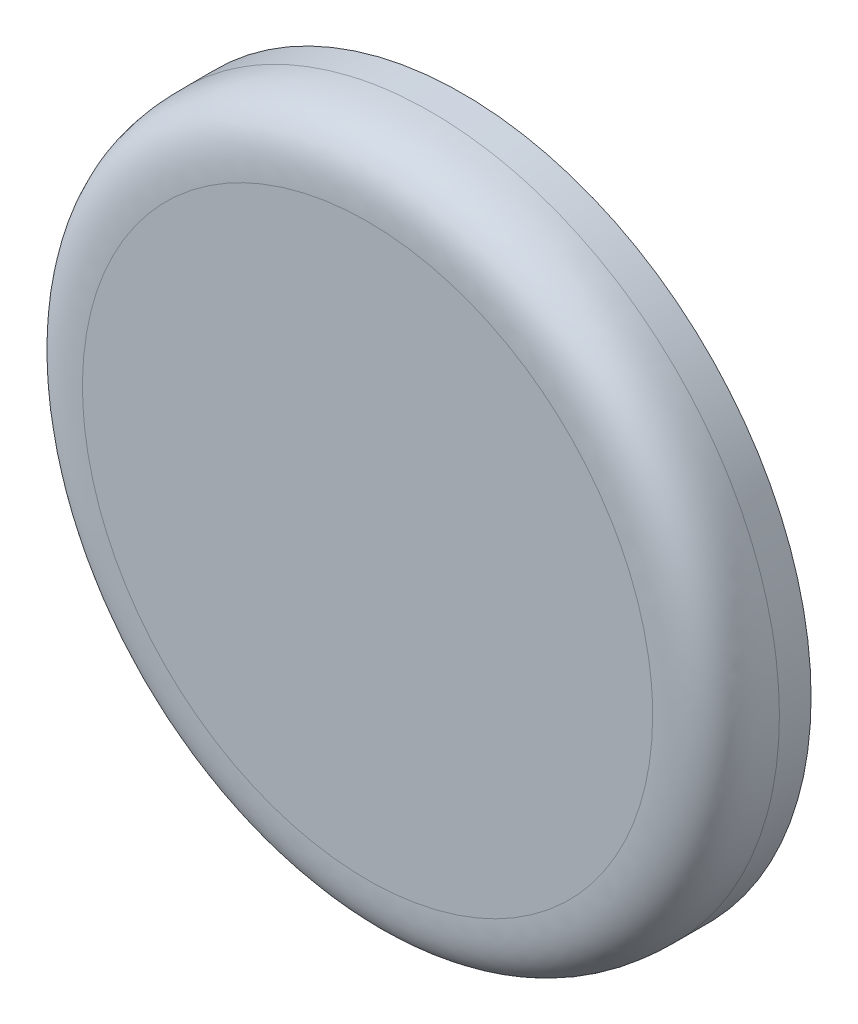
ISO-10303-21;
HEADER;
FILE_DESCRIPTION(('STEP AP214'),'2;1');
FILE_NAME('part.step','',(''),(''),'','','');
FILE_SCHEMA(('AUTOMOTIVE_DESIGN { 1 0 10303 214 1 1 1 1 }'));
ENDSEC;
DATA;
#1=APPLICATION_CONTEXT('core data for automotive mechanical design processes');
#2=APPLICATION_PROTOCOL_DEFINITION('international standard','automotive_design',2000,#1);
#3=PRODUCT_CONTEXT('',#1,'mechanical');
#4=PRODUCT('Part','Part','',(#3));
#5=PRODUCT_RELATED_PRODUCT_CATEGORY('part','',(#4));
#6=PRODUCT_DEFINITION_FORMATION('','',#4);
#7=PRODUCT_DEFINITION_CONTEXT('part definition',#1,'design');
#8=PRODUCT_DEFINITION('design','',#6,#7);
#9=PRODUCT_DEFINITION_SHAPE('','',#8);
#10=(LENGTH_UNIT() NAMED_UNIT(*) SI_UNIT(.MILLI.,.METRE.));
#11=(NAMED_UNIT(*) PLANE_ANGLE_UNIT() SI_UNIT($,.RADIAN.));
#12=(NAMED_UNIT(*) SI_UNIT($,.STERADIAN.) SOLID_ANGLE_UNIT());
#13=UNCERTAINTY_MEASURE_WITH_UNIT(LENGTH_MEASURE(1.E-05),#10,'distance_accuracy_value','');
#14=(GEOMETRIC_REPRESENTATION_CONTEXT(3) GLOBAL_UNCERTAINTY_ASSIGNED_CONTEXT((#13)) GLOBAL_UNIT_ASSIGNED_CONTEXT((#10,
#11,#12)) REPRESENTATION_CONTEXT('',''));
#15=CARTESIAN_POINT('',(0.,0.,0.));
#16=DIRECTION('',(0.,0.,1.));
#17=DIRECTION('',(1.,0.,0.));
#18=AXIS2_PLACEMENT_3D('',#15,#16,#17);
#19=CARTESIAN_POINT('',(0.,0.,15.));
#20=DIRECTION('',(0.,0.,-1.));
#21=DIRECTION('',(-1.,0.,0.));
#22=AXIS2_PLACEMENT_3D('',#19,#20,#21);
#23=CYLINDRICAL_SURFACE('',#22,55.);
#24=CARTESIAN_POINT('',(55.,0.,5.));
#25=CARTESIAN_POINT('',(55.,7.19851435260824,5.));
#26=CARTESIAN_POINT('',(52.1362529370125,21.5955430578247,5.));
#27=CARTESIAN_POINT('',(39.9033604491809,39.9033604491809,5.));
#28=CARTESIAN_POINT('',(21.5955430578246,52.1362529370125,5.));
#29=CARTESIAN_POINT('',(0.,56.4318735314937,5.));
#30=CARTESIAN_POINT('',(-21.5955430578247,52.1362529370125,5.));
#31=CARTESIAN_POINT('',(-39.9033604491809,39.9033604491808,5.));
#32=CARTESIAN_POINT('',(-52.1362529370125,21.5955430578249,5.));
#33=CARTESIAN_POINT('',(-56.4318735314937,0.,5.));
#34=CARTESIAN_POINT('',(-52.1362529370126,-21.5955430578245,5.));
#35=CARTESIAN_POINT('',(-39.9033604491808,-39.903360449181,5.));
#36=CARTESIAN_POINT('',(-21.5955430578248,-52.1362529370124,5.));
#37=CARTESIAN_POINT('',(2.29118612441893E-13,-56.4318735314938,5.));
#38=CARTESIAN_POINT('',(21.5955430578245,-52.1362529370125,5.));
#39=CARTESIAN_POINT('',(39.9033604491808,-39.903360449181,5.));
#40=CARTESIAN_POINT('',(52.1362529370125,-21.5955430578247,5.));
#41=CARTESIAN_POINT('',(55.,-7.19851435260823,5.));
#42=CARTESIAN_POINT('',(55.,0.,5.));
#43=B_SPLINE_CURVE_WITH_KNOTS('',3,(#24,#25,#26,#27,#28,#29,#30,#31,#32,#33,#34,#35,#36,#37,#38,
#39,#40,#41,#42),.UNSPECIFIED.,.T.,.F.,(4,1,1,1,1,1,1,1,1,1,1,1,1,1,1,1,4),(0.,
0.392699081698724,0.785398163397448,1.17809724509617,1.5707963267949,1.96349540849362,
2.35619449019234,2.74889357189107,3.14159265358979,3.53429173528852,3.92699081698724,
4.31968989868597,4.71238898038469,5.10508806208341,5.49778714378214,5.89048622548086,
6.28318530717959),.UNSPECIFIED.);
#44=CARTESIAN_POINT('',(55.,0.,5.));
#45=VERTEX_POINT('',#44);
#46=EDGE_CURVE('E11',#45,#45,#43,.F.);
#47=ORIENTED_EDGE('',*,*,#46,.T.);
#48=EDGE_LOOP('',(#47));
#49=FACE_BOUND('',#48,.T.);
#50=CARTESIAN_POINT('',(0.,0.,0.));
#51=DIRECTION('',(0.,0.,1.));
#52=DIRECTION('',(1.,0.,0.));
#53=AXIS2_PLACEMENT_3D('',#50,#51,#52);
#54=CIRCLE('',#53,55.);
#55=CARTESIAN_POINT('',(55.,0.,0.));
#56=VERTEX_POINT('',#55);
#57=EDGE_CURVE('E405',#56,#56,#54,.T.);
#58=ORIENTED_EDGE('',*,*,#57,.T.);
#59=EDGE_LOOP('',(#58));
#60=FACE_BOUND('',#59,.T.);
#61=ADVANCED_FACE('F45',(#49,#60),#23,.T.);
#62=CARTESIAN_POINT('',(0.,0.,15.));
#63=DIRECTION('',(0.,0.,1.));
#64=DIRECTION('',(1.,0.,0.));
#65=AXIS2_PLACEMENT_3D('',#62,#63,#64);
#66=PLANE('',#65);
#67=CARTESIAN_POINT('',(45.,0.,15.));
#68=CARTESIAN_POINT('',(45.,-5.88969356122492,15.));
#69=CARTESIAN_POINT('',(42.656934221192,-17.6690806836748,15.));
#70=CARTESIAN_POINT('',(32.6482040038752,-32.6482040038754,15.));
#71=CARTESIAN_POINT('',(17.6690806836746,-42.6569342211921,15.));
#72=CARTESIAN_POINT('',(1.8638315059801E-13,-46.171532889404,15.));
#73=CARTESIAN_POINT('',(-17.6690806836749,-42.656934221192,15.));
#74=CARTESIAN_POINT('',(-32.6482040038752,-32.6482040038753,15.));
#75=CARTESIAN_POINT('',(-42.6569342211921,-17.6690806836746,15.));
#76=CARTESIAN_POINT('',(-46.171532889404,0.,15.));
#77=CARTESIAN_POINT('',(-42.656934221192,17.6690806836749,15.));
#78=CARTESIAN_POINT('',(-32.6482040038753,32.6482040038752,15.));
#79=CARTESIAN_POINT('',(-17.6690806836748,42.6569342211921,15.));
#80=CARTESIAN_POINT('',(0.,46.171532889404,15.));
#81=CARTESIAN_POINT('',(17.6690806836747,42.6569342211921,15.));
#82=CARTESIAN_POINT('',(32.6482040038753,32.6482040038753,15.));
#83=CARTESIAN_POINT('',(42.656934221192,17.6690806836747,15.));
#84=CARTESIAN_POINT('',(45.,5.88969356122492,15.));
#85=CARTESIAN_POINT('',(45.,0.,15.));
#86=B_SPLINE_CURVE_WITH_KNOTS('',3,(#67,#68,#69,#70,#71,#72,#73,#74,#75,#76,#77,#78,#79,#80,#81,
#82,#83,#84,#85),.UNSPECIFIED.,.T.,.F.,(4,1,1,1,1,1,1,1,1,1,1,1,1,1,1,1,4),(0.,
0.392699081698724,0.785398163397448,1.17809724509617,1.5707963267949,1.96349540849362,
2.35619449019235,2.74889357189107,3.14159265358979,3.53429173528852,3.92699081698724,
4.31968989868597,4.71238898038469,5.10508806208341,5.49778714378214,5.89048622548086,
6.28318530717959),.UNSPECIFIED.);
#87=CARTESIAN_POINT('',(45.,0.,15.));
#88=VERTEX_POINT('',#87);
#89=EDGE_CURVE('E57',#88,#88,#86,.F.);
#90=ORIENTED_EDGE('',*,*,#89,.T.);
#91=EDGE_LOOP('',(#90));
#92=FACE_BOUND('',#91,.T.);
#93=ADVANCED_FACE('F417',(#92),#66,.T.);
#94=CARTESIAN_POINT('',(0.,0.,0.));
#95=DIRECTION('',(0.,0.,1.));
#96=DIRECTION('',(1.,0.,0.));
#97=AXIS2_PLACEMENT_3D('',#94,#95,#96);
#98=PLANE('',#97);
#99=CARTESIAN_POINT('',(0.,0.,0.));
#100=DIRECTION('',(0.,0.,-1.));
#101=DIRECTION('',(-1.,0.,0.));
#102=AXIS2_PLACEMENT_3D('',#99,#100,#101);
#103=CIRCLE('',#102,53.9999999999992);
#104=CARTESIAN_POINT('',(53.9150349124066,3.02803738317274,0.));
#105=VERTEX_POINT('',#104);
#106=CARTESIAN_POINT('',(53.9150349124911,-3.02803738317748,0.));
#107=VERTEX_POINT('',#106);
#108=EDGE_CURVE('E508',#105,#107,#103,.T.);
#109=ORIENTED_EDGE('',*,*,#108,.F.);
#110=CARTESIAN_POINT('',(53.4158216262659,3.,0.));
#111=DIRECTION('',(0.,0.,-1.));
#112=DIRECTION('',(-1.,0.,0.));
#113=AXIS2_PLACEMENT_3D('',#110,#111,#112);
#114=CIRCLE('',#113,0.499999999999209);
#115=CARTESIAN_POINT('',(52.9166083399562,2.97196261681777,0.));
#116=VERTEX_POINT('',#115);
#117=EDGE_CURVE('E264',#116,#105,#114,.T.);
#118=ORIENTED_EDGE('',*,*,#117,.F.);
#119=CARTESIAN_POINT('',(0.,0.,0.));
#120=DIRECTION('',(0.,0.,-1.));
#121=DIRECTION('',(-1.,0.,0.));
#122=AXIS2_PLACEMENT_3D('',#119,#120,#121);
#123=CIRCLE('',#122,53.0000000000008);
#124=CARTESIAN_POINT('',(52.9166083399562,-2.97196261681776,0.));
#125=VERTEX_POINT('',#124);
#126=EDGE_CURVE('E498',#116,#125,#123,.T.);
#127=ORIENTED_EDGE('',*,*,#126,.T.);
#128=CARTESIAN_POINT('',(53.4158216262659,-3.,0.));
#129=DIRECTION('',(0.,0.,-1.));
#130=DIRECTION('',(-1.,0.,0.));
#131=AXIS2_PLACEMENT_3D('',#128,#129,#130);
#132=CIRCLE('',#131,0.499999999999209);
#133=EDGE_CURVE('E503',#107,#125,#132,.T.);
#134=ORIENTED_EDGE('',*,*,#133,.F.);
#135=EDGE_LOOP('',(#109,#118,#127,#134));
#136=FACE_BOUND('',#135,.T.);
#137=CARTESIAN_POINT('',(0.,0.,0.));
#138=DIRECTION('',(0.,0.,-1.));
#139=DIRECTION('',(-1.,0.,0.));
#140=AXIS2_PLACEMENT_3D('',#137,#138,#139);
#141=CIRCLE('',#140,54.0000000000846);
#142=CARTESIAN_POINT('',(-3.02803738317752,53.9150349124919,0.));
#143=VERTEX_POINT('',#142);
#144=CARTESIAN_POINT('',(3.02803738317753,53.9150349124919,0.));
#145=VERTEX_POINT('',#144);
#146=EDGE_CURVE('E257',#143,#145,#141,.T.);
#147=ORIENTED_EDGE('',*,*,#146,.F.);
#148=CARTESIAN_POINT('',(-3.,53.4158216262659,0.));
#149=DIRECTION('',(0.,0.,-1.));
#150=DIRECTION('',(-1.,0.,0.));
#151=AXIS2_PLACEMENT_3D('',#148,#149,#150);
#152=CIRCLE('',#151,0.500000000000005);
#153=CARTESIAN_POINT('',(-2.97196261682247,52.9166083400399,0.));
#154=VERTEX_POINT('',#153);
#155=EDGE_CURVE('E261',#154,#143,#152,.T.);
#156=ORIENTED_EDGE('',*,*,#155,.F.);
#157=CARTESIAN_POINT('',(0.,0.,0.));
#158=DIRECTION('',(0.,0.,-1.));
#159=DIRECTION('',(-1.,0.,0.));
#160=AXIS2_PLACEMENT_3D('',#157,#158,#159);
#161=CIRCLE('',#160,53.0000000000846);
#162=CARTESIAN_POINT('',(2.97196261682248,52.9166083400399,0.));
#163=VERTEX_POINT('',#162);
#164=EDGE_CURVE('E234',#154,#163,#161,.T.);
#165=ORIENTED_EDGE('',*,*,#164,.T.);
#166=CARTESIAN_POINT('',(3.,53.4158216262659,0.));
#167=DIRECTION('',(0.,0.,-1.));
#168=DIRECTION('',(-1.,0.,0.));
#169=AXIS2_PLACEMENT_3D('',#166,#167,#168);
#170=CIRCLE('',#169,0.500000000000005);
#171=EDGE_CURVE('E252',#145,#163,#170,.T.);
#172=ORIENTED_EDGE('',*,*,#171,.F.);
#173=EDGE_LOOP('',(#147,#156,#165,#172));
#174=FACE_BOUND('',#173,.T.);
#175=CARTESIAN_POINT('',(0.,0.,0.));
#176=DIRECTION('',(0.,0.,-1.));
#177=DIRECTION('',(-1.,0.,0.));
#178=AXIS2_PLACEMENT_3D('',#175,#176,#177);
#179=CIRCLE('',#178,54.0000000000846);
#180=CARTESIAN_POINT('',(-53.9150349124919,-3.02803738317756,0.));
#181=VERTEX_POINT('',#180);
#182=CARTESIAN_POINT('',(-53.9150349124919,3.02803738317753,0.));
#183=VERTEX_POINT('',#182);
#184=EDGE_CURVE('E246',#181,#183,#179,.T.);
#185=ORIENTED_EDGE('',*,*,#184,.F.);
#186=CARTESIAN_POINT('',(-53.4158216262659,-2.99999999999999,0.));
#187=DIRECTION('',(0.,0.,-1.));
#188=DIRECTION('',(-1.,0.,0.));
#189=AXIS2_PLACEMENT_3D('',#186,#187,#188);
#190=CIRCLE('',#189,0.500000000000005);
#191=CARTESIAN_POINT('',(-52.9166083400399,-2.9719626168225,0.));
#192=VERTEX_POINT('',#191);
#193=EDGE_CURVE('E238',#192,#181,#190,.T.);
#194=ORIENTED_EDGE('',*,*,#193,.F.);
#195=CARTESIAN_POINT('',(0.,0.,0.));
#196=DIRECTION('',(0.,0.,-1.));
#197=DIRECTION('',(-1.,0.,0.));
#198=AXIS2_PLACEMENT_3D('',#195,#196,#197);
#199=CIRCLE('',#198,53.0000000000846);
#200=CARTESIAN_POINT('',(-52.9166083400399,2.97196261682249,0.));
#201=VERTEX_POINT('',#200);
#202=EDGE_CURVE('E289',#192,#201,#199,.T.);
#203=ORIENTED_EDGE('',*,*,#202,.T.);
#204=CARTESIAN_POINT('',(-53.4158216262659,3.00000000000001,0.));
#205=DIRECTION('',(0.,0.,-1.));
#206=DIRECTION('',(-1.,0.,0.));
#207=AXIS2_PLACEMENT_3D('',#204,#205,#206);
#208=CIRCLE('',#207,0.500000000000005);
#209=EDGE_CURVE('E293',#183,#201,#208,.T.);
#210=ORIENTED_EDGE('',*,*,#209,.F.);
#211=EDGE_LOOP('',(#185,#194,#203,#210));
#212=FACE_BOUND('',#211,.T.);
#213=CARTESIAN_POINT('',(0.,0.,0.));
#214=DIRECTION('',(0.,0.,-1.));
#215=DIRECTION('',(-1.,0.,0.));
#216=AXIS2_PLACEMENT_3D('',#213,#214,#215);
#217=CIRCLE('',#216,54.0000000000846);
#218=CARTESIAN_POINT('',(3.02803738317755,-53.9150349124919,0.));
#219=VERTEX_POINT('',#218);
#220=CARTESIAN_POINT('',(-3.02803738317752,-53.9150349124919,0.));
#221=VERTEX_POINT('',#220);
#222=EDGE_CURVE('E333',#219,#221,#217,.T.);
#223=ORIENTED_EDGE('',*,*,#222,.F.);
#224=CARTESIAN_POINT('',(3.,-53.4158216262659,0.));
#225=DIRECTION('',(0.,0.,-1.));
#226=DIRECTION('',(-1.,0.,0.));
#227=AXIS2_PLACEMENT_3D('',#224,#225,#226);
#228=CIRCLE('',#227,0.500000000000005);
#229=CARTESIAN_POINT('',(2.9719626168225,-52.9166083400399,0.));
#230=VERTEX_POINT('',#229);
#231=EDGE_CURVE('E288',#230,#219,#228,.T.);
#232=ORIENTED_EDGE('',*,*,#231,.F.);
#233=CARTESIAN_POINT('',(0.,0.,0.));
#234=DIRECTION('',(0.,0.,-1.));
#235=DIRECTION('',(-1.,0.,0.));
#236=AXIS2_PLACEMENT_3D('',#233,#234,#235);
#237=CIRCLE('',#236,53.0000000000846);
#238=CARTESIAN_POINT('',(-2.97196261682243,-52.9166083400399,0.));
#239=VERTEX_POINT('',#238);
#240=EDGE_CURVE('E324',#230,#239,#237,.T.);
#241=ORIENTED_EDGE('',*,*,#240,.T.);
#242=CARTESIAN_POINT('',(-3.,-53.4158216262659,0.));
#243=DIRECTION('',(0.,0.,-1.));
#244=DIRECTION('',(-1.,0.,0.));
#245=AXIS2_PLACEMENT_3D('',#242,#243,#244);
#246=CIRCLE('',#245,0.500000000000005);
#247=EDGE_CURVE('E328',#221,#239,#246,.T.);
#248=ORIENTED_EDGE('',*,*,#247,.F.);
#249=EDGE_LOOP('',(#223,#232,#241,#248));
#250=FACE_BOUND('',#249,.T.);
#251=CARTESIAN_POINT('',(0.,0.,0.));
#252=DIRECTION('',(0.,0.,1.));
#253=DIRECTION('',(1.,0.,0.));
#254=AXIS2_PLACEMENT_3D('',#251,#252,#253);
#255=CIRCLE('',#254,52.);
#256=CARTESIAN_POINT('',(52.,0.,0.));
#257=VERTEX_POINT('',#256);
#258=EDGE_CURVE('E394',#257,#257,#255,.T.);
#259=ORIENTED_EDGE('',*,*,#258,.T.);
#260=EDGE_LOOP('',(#259));
#261=FACE_BOUND('',#260,.T.);
#262=ORIENTED_EDGE('',*,*,#57,.F.);
#263=EDGE_LOOP('',(#262));
#264=FACE_BOUND('',#263,.T.);
#265=ADVANCED_FACE('F425',(#136,#174,#212,#250,#261,#264),#98,.F.);
#266=CARTESIAN_POINT('',(45.,0.,15.));
#267=CARTESIAN_POINT('',(45.,5.88969356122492,15.));
#268=CARTESIAN_POINT('',(42.656934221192,17.6690806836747,15.));
#269=CARTESIAN_POINT('',(32.6482040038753,32.6482040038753,15.));
#270=CARTESIAN_POINT('',(17.6690806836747,42.6569342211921,15.));
#271=CARTESIAN_POINT('',(0.,46.171532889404,15.));
#272=CARTESIAN_POINT('',(-17.6690806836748,42.6569342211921,15.));
#273=CARTESIAN_POINT('',(-32.6482040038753,32.6482040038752,15.));
#274=CARTESIAN_POINT('',(-42.656934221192,17.6690806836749,15.));
#275=CARTESIAN_POINT('',(-46.171532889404,0.,15.));
#276=CARTESIAN_POINT('',(-42.6569342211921,-17.6690806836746,15.));
#277=CARTESIAN_POINT('',(-32.6482040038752,-32.6482040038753,15.));
#278=CARTESIAN_POINT('',(-17.6690806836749,-42.656934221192,15.));
#279=CARTESIAN_POINT('',(1.8638315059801E-13,-46.171532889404,15.));
#280=CARTESIAN_POINT('',(17.6690806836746,-42.6569342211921,15.));
#281=CARTESIAN_POINT('',(32.6482040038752,-32.6482040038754,15.));
#282=CARTESIAN_POINT('',(42.656934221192,-17.6690806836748,15.));
#283=CARTESIAN_POINT('',(45.,-5.88969356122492,15.));
#284=CARTESIAN_POINT('',(45.,0.,15.));
#285=CARTESIAN_POINT('',(46.6819805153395,0.,15.));
#286=CARTESIAN_POINT('',(46.6819805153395,6.10983466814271,15.));
#287=CARTESIAN_POINT('',(44.2513371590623,18.3295040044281,15.));
#288=CARTESIAN_POINT('',(33.8685071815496,33.8685071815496,15.));
#289=CARTESIAN_POINT('',(18.3295040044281,44.2513371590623,15.));
#290=CARTESIAN_POINT('',(0.,47.897302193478,15.));
#291=CARTESIAN_POINT('',(-18.3295040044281,44.2513371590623,15.));
#292=CARTESIAN_POINT('',(-33.8685071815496,33.8685071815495,15.));
#293=CARTESIAN_POINT('',(-44.2513371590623,18.3295040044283,15.));
#294=CARTESIAN_POINT('',(-47.897302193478,0.,15.));
#295=CARTESIAN_POINT('',(-44.2513371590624,-18.329504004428,15.));
#296=CARTESIAN_POINT('',(-33.8685071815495,-33.8685071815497,15.));
#297=CARTESIAN_POINT('',(-18.3295040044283,-44.2513371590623,15.));
#298=CARTESIAN_POINT('',(1.92624455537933E-13,-47.8973021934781,15.));
#299=CARTESIAN_POINT('',(18.329504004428,-44.2513371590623,15.));
#300=CARTESIAN_POINT('',(33.8685071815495,-33.8685071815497,15.));
#301=CARTESIAN_POINT('',(44.2513371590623,-18.3295040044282,15.));
#302=CARTESIAN_POINT('',(46.6819805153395,-6.10983466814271,15.));
#303=CARTESIAN_POINT('',(46.6819805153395,0.,15.));
#304=CARTESIAN_POINT('',(48.3639610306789,0.,15.));
#305=CARTESIAN_POINT('',(48.3639610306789,6.32997577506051,15.));
#306=CARTESIAN_POINT('',(45.8457400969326,18.9899273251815,15.));
#307=CARTESIAN_POINT('',(35.088810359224,35.088810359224,15.));
#308=CARTESIAN_POINT('',(18.9899273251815,45.8457400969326,15.));
#309=CARTESIAN_POINT('',(0.,49.6230714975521,15.));
#310=CARTESIAN_POINT('',(-18.9899273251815,45.8457400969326,15.));
#311=CARTESIAN_POINT('',(-35.088810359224,35.0888103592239,15.));
#312=CARTESIAN_POINT('',(-45.8457400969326,18.9899273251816,15.));
#313=CARTESIAN_POINT('',(-49.6230714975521,0.,15.));
#314=CARTESIAN_POINT('',(-45.8457400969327,-18.9899273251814,15.));
#315=CARTESIAN_POINT('',(-35.0888103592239,-35.088810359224,15.));
#316=CARTESIAN_POINT('',(-18.9899273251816,-45.8457400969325,15.));
#317=CARTESIAN_POINT('',(2.00260213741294E-13,-49.6230714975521,15.));
#318=CARTESIAN_POINT('',(18.9899273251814,-45.8457400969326,15.));
#319=CARTESIAN_POINT('',(35.0888103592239,-35.0888103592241,15.));
#320=CARTESIAN_POINT('',(45.8457400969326,-18.9899273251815,15.));
#321=CARTESIAN_POINT('',(48.3639610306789,-6.3299757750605,15.));
#322=CARTESIAN_POINT('',(48.3639610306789,0.,15.));
#323=CARTESIAN_POINT('',(52.0710678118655,0.,14.2830808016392));
#324=CARTESIAN_POINT('',(52.0710678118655,6.81516961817,14.2830808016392));
#325=CARTESIAN_POINT('',(49.3598247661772,20.44550885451,14.2830808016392));
#326=CARTESIAN_POINT('',(37.7783743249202,37.7783743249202,14.2830808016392));
#327=CARTESIAN_POINT('',(20.44550885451,49.3598247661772,14.2830808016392));
#328=CARTESIAN_POINT('',(0.,53.4266893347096,14.2830808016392));
#329=CARTESIAN_POINT('',(-20.44550885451,49.3598247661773,14.2830808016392));
#330=CARTESIAN_POINT('',(-37.7783743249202,37.7783743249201,14.2830808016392));
#331=CARTESIAN_POINT('',(-49.3598247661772,20.4455088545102,14.2830808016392));
#332=CARTESIAN_POINT('',(-53.4266893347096,0.,14.2830808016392));
#333=CARTESIAN_POINT('',(-49.3598247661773,-20.4455088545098,14.2830808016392));
#334=CARTESIAN_POINT('',(-37.77837432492,-37.7783743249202,14.2830808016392));
#335=CARTESIAN_POINT('',(-20.4455088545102,-49.3598247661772,14.2830808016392));
#336=CARTESIAN_POINT('',(2.180614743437E-13,-53.4266893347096,14.2830808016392));
#337=CARTESIAN_POINT('',(20.4455088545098,-49.3598247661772,14.2830808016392));
#338=CARTESIAN_POINT('',(37.7783743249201,-37.7783743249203,14.2830808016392));
#339=CARTESIAN_POINT('',(49.3598247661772,-20.44550885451,14.2830808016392));
#340=CARTESIAN_POINT('',(52.0710678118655,-6.81516961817,14.2830808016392));
#341=CARTESIAN_POINT('',(52.0710678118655,0.,14.2830808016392));
#342=CARTESIAN_POINT('',(54.2830808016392,0.,12.0710678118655));
#343=CARTESIAN_POINT('',(54.2830808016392,7.10468247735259,12.0710678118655));
#344=CARTESIAN_POINT('',(51.4566623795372,21.3140474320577,12.0710678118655));
#345=CARTESIAN_POINT('',(39.3832243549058,39.3832243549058,12.0710678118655));
#346=CARTESIAN_POINT('',(21.3140474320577,51.4566623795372,12.0710678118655));
#347=CARTESIAN_POINT('',(0.,55.6962900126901,12.0710678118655));
#348=CARTESIAN_POINT('',(-21.3140474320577,51.4566623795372,12.0710678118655));
#349=CARTESIAN_POINT('',(-39.3832243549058,39.3832243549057,12.0710678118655));
#350=CARTESIAN_POINT('',(-51.4566623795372,21.3140474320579,12.0710678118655));
#351=CARTESIAN_POINT('',(-55.6962900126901,0.,12.0710678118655));
#352=CARTESIAN_POINT('',(-51.4566623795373,-21.3140474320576,12.0710678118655));
#353=CARTESIAN_POINT('',(-39.3832243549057,-39.3832243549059,12.0710678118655));
#354=CARTESIAN_POINT('',(-21.3140474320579,-51.4566623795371,12.0710678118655));
#355=CARTESIAN_POINT('',(2.25356850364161E-13,-55.6962900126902,12.0710678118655));
#356=CARTESIAN_POINT('',(21.3140474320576,-51.4566623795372,12.0710678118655));
#357=CARTESIAN_POINT('',(39.3832243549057,-39.3832243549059,12.0710678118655));
#358=CARTESIAN_POINT('',(51.4566623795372,-21.3140474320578,12.0710678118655));
#359=CARTESIAN_POINT('',(54.2830808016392,-7.10468247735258,12.0710678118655));
#360=CARTESIAN_POINT('',(54.2830808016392,0.,12.0710678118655));
#361=CARTESIAN_POINT('',(55.,0.,8.36396103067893));
#362=CARTESIAN_POINT('',(55.,7.19851435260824,8.36396103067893));
#363=CARTESIAN_POINT('',(52.1362529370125,21.5955430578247,8.36396103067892));
#364=CARTESIAN_POINT('',(39.9033604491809,39.9033604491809,8.36396103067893));
#365=CARTESIAN_POINT('',(21.5955430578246,52.1362529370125,8.36396103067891));
#366=CARTESIAN_POINT('',(0.,56.4318735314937,8.36396103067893));
#367=CARTESIAN_POINT('',(-21.5955430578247,52.1362529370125,8.36396103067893));
#368=CARTESIAN_POINT('',(-39.9033604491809,39.9033604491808,8.36396103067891));
#369=CARTESIAN_POINT('',(-52.1362529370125,21.5955430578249,8.36396103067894));
#370=CARTESIAN_POINT('',(-56.4318735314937,0.,8.36396103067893));
#371=CARTESIAN_POINT('',(-52.1362529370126,-21.5955430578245,8.36396103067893));
#372=CARTESIAN_POINT('',(-39.9033604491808,-39.903360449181,8.36396103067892));
#373=CARTESIAN_POINT('',(-21.5955430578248,-52.1362529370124,8.36396103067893));
#374=CARTESIAN_POINT('',(2.29118612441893E-13,-56.4318735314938,8.36396103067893));
#375=CARTESIAN_POINT('',(21.5955430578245,-52.1362529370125,8.36396103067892));
#376=CARTESIAN_POINT('',(39.9033604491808,-39.903360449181,8.36396103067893));
#377=CARTESIAN_POINT('',(52.1362529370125,-21.5955430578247,8.36396103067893));
#378=CARTESIAN_POINT('',(55.,-7.19851435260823,8.36396103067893));
#379=CARTESIAN_POINT('',(55.,0.,8.36396103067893));
#380=CARTESIAN_POINT('',(55.,0.,6.68198051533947));
#381=CARTESIAN_POINT('',(55.,7.19851435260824,6.68198051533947));
#382=CARTESIAN_POINT('',(52.1362529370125,21.5955430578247,6.68198051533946));
#383=CARTESIAN_POINT('',(39.9033604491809,39.9033604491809,6.68198051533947));
#384=CARTESIAN_POINT('',(21.5955430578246,52.1362529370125,6.68198051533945));
#385=CARTESIAN_POINT('',(0.,56.4318735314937,6.68198051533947));
#386=CARTESIAN_POINT('',(-21.5955430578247,52.1362529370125,6.68198051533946));
#387=CARTESIAN_POINT('',(-39.9033604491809,39.9033604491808,6.68198051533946));
#388=CARTESIAN_POINT('',(-52.1362529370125,21.5955430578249,6.68198051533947));
#389=CARTESIAN_POINT('',(-56.4318735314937,0.,6.68198051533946));
#390=CARTESIAN_POINT('',(-52.1362529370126,-21.5955430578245,6.68198051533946));
#391=CARTESIAN_POINT('',(-39.9033604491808,-39.903360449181,6.68198051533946));
#392=CARTESIAN_POINT('',(-21.5955430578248,-52.1362529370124,6.68198051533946));
#393=CARTESIAN_POINT('',(2.29118612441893E-13,-56.4318735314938,6.68198051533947));
#394=CARTESIAN_POINT('',(21.5955430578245,-52.1362529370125,6.68198051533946));
#395=CARTESIAN_POINT('',(39.9033604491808,-39.903360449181,6.68198051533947));
#396=CARTESIAN_POINT('',(52.1362529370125,-21.5955430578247,6.68198051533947));
#397=CARTESIAN_POINT('',(55.,-7.19851435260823,6.68198051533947));
#398=CARTESIAN_POINT('',(55.,0.,6.68198051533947));
#399=CARTESIAN_POINT('',(55.,0.,5.));
#400=CARTESIAN_POINT('',(55.,7.19851435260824,5.));
#401=CARTESIAN_POINT('',(52.1362529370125,21.5955430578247,5.));
#402=CARTESIAN_POINT('',(39.9033604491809,39.9033604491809,5.));
#403=CARTESIAN_POINT('',(21.5955430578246,52.1362529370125,5.));
#404=CARTESIAN_POINT('',(0.,56.4318735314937,5.));
#405=CARTESIAN_POINT('',(-21.5955430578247,52.1362529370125,5.));
#406=CARTESIAN_POINT('',(-39.9033604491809,39.9033604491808,5.));
#407=CARTESIAN_POINT('',(-52.1362529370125,21.5955430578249,5.));
#408=CARTESIAN_POINT('',(-56.4318735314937,0.,5.));
#409=CARTESIAN_POINT('',(-52.1362529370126,-21.5955430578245,5.));
#410=CARTESIAN_POINT('',(-39.9033604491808,-39.903360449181,5.));
#411=CARTESIAN_POINT('',(-21.5955430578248,-52.1362529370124,5.));
#412=CARTESIAN_POINT('',(2.29118612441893E-13,-56.4318735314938,5.));
#413=CARTESIAN_POINT('',(21.5955430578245,-52.1362529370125,5.));
#414=CARTESIAN_POINT('',(39.9033604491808,-39.903360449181,5.));
#415=CARTESIAN_POINT('',(52.1362529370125,-21.5955430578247,5.));
#416=CARTESIAN_POINT('',(55.,-7.19851435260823,5.));
#417=CARTESIAN_POINT('',(55.,0.,5.));
#418=B_SPLINE_SURFACE_WITH_KNOTS('',5,3,((#266,#267,#268,#269,#270,#271,#272,#273,#274,#275,
#276,#277,#278,#279,#280,#281,#282,#283,#284),(#285,#286,#287,#288,#289,#290,#291,#292,#293,
#294,#295,#296,#297,#298,#299,#300,#301,#302,#303),(#304,#305,#306,#307,#308,#309,#310,#311,
#312,#313,#314,#315,#316,#317,#318,#319,#320,#321,#322),(#323,#324,#325,#326,#327,#328,#329,
#330,#331,#332,#333,#334,#335,#336,#337,#338,#339,#340,#341),(#342,#343,#344,#345,#346,#347,
#348,#349,#350,#351,#352,#353,#354,#355,#356,#357,#358,#359,#360),(#361,#362,#363,#364,#365,
#366,#367,#368,#369,#370,#371,#372,#373,#374,#375,#376,#377,#378,#379),(#380,#381,#382,#383,
#384,#385,#386,#387,#388,#389,#390,#391,#392,#393,#394,#395,#396,#397,#398),(#399,#400,#401,
#402,#403,#404,#405,#406,#407,#408,#409,#410,#411,#412,#413,#414,#415,#416,#417)),.UNSPECIFIED.,
.F.,.T.,.F.,(6,2,6),(4,1,1,1,1,1,1,1,1,1,1,1,1,1,1,1,4),(0.,0.5,1.),(0.,0.392699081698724,
0.785398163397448,1.17809724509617,1.5707963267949,1.96349540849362,2.35619449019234,
2.74889357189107,3.14159265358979,3.53429173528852,3.92699081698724,4.31968989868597,
4.71238898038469,5.10508806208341,5.49778714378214,5.89048622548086,6.28318530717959),.UNSPECIFIED.);
#419=ORIENTED_EDGE('',*,*,#46,.F.);
#420=EDGE_LOOP('',(#419));
#421=FACE_BOUND('',#420,.T.);
#422=ORIENTED_EDGE('',*,*,#89,.F.);
#423=EDGE_LOOP('',(#422));
#424=FACE_BOUND('',#423,.T.);
#425=ADVANCED_FACE('F369',(#421,#424),#418,.T.);
#426=CARTESIAN_POINT('',(0.,0.,15.));
#427=DIRECTION('',(0.,0.,-1.));
#428=DIRECTION('',(-1.,0.,0.));
#429=AXIS2_PLACEMENT_3D('',#426,#427,#428);
#430=CYLINDRICAL_SURFACE('',#429,52.);
#431=CARTESIAN_POINT('',(52.,1.89267596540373E-10,5.));
#432=CARTESIAN_POINT('',(51.9999995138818,0.85032547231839,5.));
#433=CARTESIAN_POINT('',(51.9788515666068,1.70063242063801,5.));
#434=CARTESIAN_POINT('',(51.8946677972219,3.39958740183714,5.));
#435=CARTESIAN_POINT('',(51.8316116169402,4.24823442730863,5.));
#436=CARTESIAN_POINT('',(51.6639892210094,5.94172038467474,5.));
#437=CARTESIAN_POINT('',(51.5594081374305,6.78655784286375,5.));
#438=CARTESIAN_POINT('',(51.3091288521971,8.47028261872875,5.));
#439=CARTESIAN_POINT('',(51.1634228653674,9.30916877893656,5.));
#440=CARTESIAN_POINT('',(50.8313038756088,10.9788437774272,5.));
#441=CARTESIAN_POINT('',(50.6448908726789,11.8096326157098,5.));
#442=CARTESIAN_POINT('',(50.2317850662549,13.4609695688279,5.));
#443=CARTESIAN_POINT('',(50.0050998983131,14.2815195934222,5.));
#444=CARTESIAN_POINT('',(49.5118943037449,15.9102414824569,5.));
#445=CARTESIAN_POINT('',(49.2453881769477,16.7184176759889,5.));
#446=CARTESIAN_POINT('',(48.6729999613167,18.3202685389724,5.));
#447=CARTESIAN_POINT('',(48.3671370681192,19.1139500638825,5.));
#448=CARTESIAN_POINT('',(47.7163343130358,20.6851269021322,5.));
#449=CARTESIAN_POINT('',(47.3713944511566,21.4626222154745,5.));
#450=CARTESIAN_POINT('',(46.6434544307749,23.0000414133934,5.));
#451=CARTESIAN_POINT('',(46.2604358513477,23.7599565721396,5.));
#452=CARTESIAN_POINT('',(45.4575045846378,25.2603858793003,5.));
#453=CARTESIAN_POINT('',(45.0375787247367,26.0008929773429,5.));
#454=CARTESIAN_POINT('',(44.162017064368,27.4606744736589,5.));
#455=CARTESIAN_POINT('',(43.7063745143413,28.1799448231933,5.));
#456=CARTESIAN_POINT('',(42.7605796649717,29.5954268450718,5.));
#457=CARTESIAN_POINT('',(42.2704273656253,30.2916385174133,5.));
#458=CARTESIAN_POINT('',(41.2568280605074,31.6591862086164,5.));
#459=CARTESIAN_POINT('',(40.733387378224,32.3305269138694,5.));
#460=CARTESIAN_POINT('',(39.6544399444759,33.6465281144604,5.));
#461=CARTESIAN_POINT('',(39.0989447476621,34.2911980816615,5.));
#462=CARTESIAN_POINT('',(37.9571252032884,35.5520718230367,5.));
#463=CARTESIAN_POINT('',(37.3708159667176,36.1682892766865,5.));
#464=CARTESIAN_POINT('',(36.1682892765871,37.3708159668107,5.));
#465=CARTESIAN_POINT('',(35.552071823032,37.9571252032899,5.));
#466=CARTESIAN_POINT('',(34.2911980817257,39.0989447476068,5.));
#467=CARTESIAN_POINT('',(33.646528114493,39.6544399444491,5.));
#468=CARTESIAN_POINT('',(32.3305269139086,40.7333873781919,5.));
#469=CARTESIAN_POINT('',(31.6591862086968,41.2568280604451,5.));
#470=CARTESIAN_POINT('',(30.291638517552,42.2704273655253,5.));
#471=CARTESIAN_POINT('',(29.5954268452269,42.760579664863,5.));
#472=CARTESIAN_POINT('',(28.179944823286,43.7063745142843,5.));
#473=CARTESIAN_POINT('',(27.4606744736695,44.1620170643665,5.));
#474=CARTESIAN_POINT('',(26.0008929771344,45.0375787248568,5.));
#475=CARTESIAN_POINT('',(25.2603858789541,45.4575045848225,5.));
#476=CARTESIAN_POINT('',(23.7599565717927,46.2604358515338,5.));
#477=CARTESIAN_POINT('',(23.0000414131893,46.643454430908,5.));
#478=CARTESIAN_POINT('',(21.462622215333,47.3713944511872,5.));
#479=CARTESIAN_POINT('',(20.6851269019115,47.7163343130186,5.));
#480=CARTESIAN_POINT('',(19.1139500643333,48.3671370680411,5.));
#481=CARTESIAN_POINT('',(18.3202685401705,48.6729999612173,5.));
#482=CARTESIAN_POINT('',(16.7184176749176,49.2453881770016,5.));
#483=CARTESIAN_POINT('',(15.9102414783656,49.5118943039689,5.));
#484=CARTESIAN_POINT('',(14.2815195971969,50.0050998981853,5.));
#485=CARTESIAN_POINT('',(13.4609695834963,50.2317850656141,5.));
#486=CARTESIAN_POINT('',(11.8096326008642,50.6448908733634,5.));
#487=CARTESIAN_POINT('',(10.9788437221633,50.8313038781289,5.));
#488=CARTESIAN_POINT('',(9.30916883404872,51.1634228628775,5.));
#489=CARTESIAN_POINT('',(8.47028282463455,51.3091288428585,5.));
#490=CARTESIAN_POINT('',(6.78655763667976,51.5594081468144,5.));
#491=CARTESIAN_POINT('',(5.94171961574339,51.6639892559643,5.));
#492=CARTESIAN_POINT('',(4.24823519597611,51.8316115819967,5.));
#493=CARTESIAN_POINT('',(3.39959026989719,51.8946676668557,5.));
#494=CARTESIAN_POINT('',(1.70062955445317,51.9788516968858,5.));
#495=CARTESIAN_POINT('',(0.850314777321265,51.9999999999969,5.));
#496=CARTESIAN_POINT('',(-0.850314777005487,52.0000000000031,5.));
#497=CARTESIAN_POINT('',(-1.70062955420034,51.9788516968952,5.));
#498=CARTESIAN_POINT('',(-3.39959026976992,51.8946676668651,5.));
#499=CARTESIAN_POINT('',(-4.24823519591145,51.8316115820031,5.));
#500=CARTESIAN_POINT('',(-5.94171961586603,51.6639892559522,5.));
#501=CARTESIAN_POINT('',(-6.78655763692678,51.5594081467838,5.));
#502=CARTESIAN_POINT('',(-8.47028282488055,51.3091288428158,5.));
#503=CARTESIAN_POINT('',(-9.3091688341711,51.1634228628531,5.));
#504=CARTESIAN_POINT('',(-10.9788437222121,50.8313038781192,5.));
#505=CARTESIAN_POINT('',(-11.8096326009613,50.6448908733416,5.));
#506=CARTESIAN_POINT('',(-13.4609695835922,50.2317850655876,5.));
#507=CARTESIAN_POINT('',(-14.2815195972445,50.0050998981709,5.));
#508=CARTESIAN_POINT('',(-15.9102414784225,49.5118943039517,5.));
#509=CARTESIAN_POINT('',(-16.7184176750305,49.2453881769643,5.));
#510=CARTESIAN_POINT('',(-18.3202685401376,48.672999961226,5.));
#511=CARTESIAN_POINT('',(-19.113950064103,48.3671370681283,5.));
#512=CARTESIAN_POINT('',(-20.6851269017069,47.7163343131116,5.));
#513=CARTESIAN_POINT('',(-21.462622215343,47.3713944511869,5.));
#514=CARTESIAN_POINT('',(-23.0000414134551,46.6434544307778,5.));
#515=CARTESIAN_POINT('',(-23.7599565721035,46.2604358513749,5.));
#516=CARTESIAN_POINT('',(-25.2603858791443,45.4575045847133,5.));
#517=CARTESIAN_POINT('',(-26.0008929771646,45.037578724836,5.));
#518=CARTESIAN_POINT('',(-27.4606744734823,44.1620170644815,5.));
#519=CARTESIAN_POINT('',(-28.1799448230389,43.7063745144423,5.));
#520=CARTESIAN_POINT('',(-29.5954268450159,42.7605796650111,5.));
#521=CARTESIAN_POINT('',(-30.2916385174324,42.2704273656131,5.));
#522=CARTESIAN_POINT('',(-31.6591862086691,41.2568280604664,5.));
#523=CARTESIAN_POINT('',(-32.3305269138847,40.7333873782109,5.));
#524=CARTESIAN_POINT('',(-33.6465281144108,39.654439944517,5.));
#525=CARTESIAN_POINT('',(-34.2911980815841,39.0989447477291,5.));
#526=CARTESIAN_POINT('',(-35.552071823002,37.9571252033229,5.));
#527=CARTESIAN_POINT('',(-36.1682892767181,37.3708159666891,5.));
#528=CARTESIAN_POINT('',(-37.3708159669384,36.1682892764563,5.));
#529=CARTESIAN_POINT('',(-37.9571252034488,35.5520718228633,5.));
#530=CARTESIAN_POINT('',(-39.0989447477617,34.2911980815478,5.));
#531=CARTESIAN_POINT('',(-39.6544399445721,33.6465281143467,5.));
#532=CARTESIAN_POINT('',(-40.7333873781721,32.3305269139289,5.));
#533=CARTESIAN_POINT('',(-41.2568280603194,31.6591862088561,5.));
#534=CARTESIAN_POINT('',(-42.2704273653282,30.2916385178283,5.));
#535=CARTESIAN_POINT('',(-42.7605796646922,29.5954268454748,5.));
#536=CARTESIAN_POINT('',(-43.7063745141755,28.1799448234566,5.));
#537=CARTESIAN_POINT('',(-44.1620170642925,27.4606744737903,5.));
#538=CARTESIAN_POINT('',(-45.0375787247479,26.0008929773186,5.));
#539=CARTESIAN_POINT('',(-45.4575045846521,25.2603858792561,5.));
#540=CARTESIAN_POINT('',(-46.2604358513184,23.7599565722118,5.));
#541=CARTESIAN_POINT('',(-46.6434544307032,23.0000414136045,5.));
#542=CARTESIAN_POINT('',(-47.3713944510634,21.462622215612,5.));
#543=CARTESIAN_POINT('',(-47.716334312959,20.6851269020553,5.));
#544=CARTESIAN_POINT('',(-48.3671370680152,19.1139500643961,5.));
#545=CARTESIAN_POINT('',(-48.6729999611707,18.3202685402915,5.));
#546=CARTESIAN_POINT('',(-49.245388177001,16.7184176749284,5.));
#547=CARTESIAN_POINT('',(-49.5118943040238,15.9102414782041,5.));
#548=CARTESIAN_POINT('',(-50.0050998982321,14.2815195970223,5.));
#549=CARTESIAN_POINT('',(-50.231785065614,13.4609695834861,5.));
#550=CARTESIAN_POINT('',(-50.6448908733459,11.8096326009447,5.));
#551=CARTESIAN_POINT('',(-50.8313038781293,10.9788437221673,5.));
#552=CARTESIAN_POINT('',(-51.1634228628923,9.30916883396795,5.));
#553=CARTESIAN_POINT('',(-51.3091288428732,8.47028282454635,5.));
#554=CARTESIAN_POINT('',(-51.5594081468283,6.78655763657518,5.));
#555=CARTESIAN_POINT('',(-51.6639892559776,5.94171961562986,5.));
#556=CARTESIAN_POINT('',(-51.8316115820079,4.24823519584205,5.));
#557=CARTESIAN_POINT('',(-51.8946676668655,3.39959026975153,5.));
#558=CARTESIAN_POINT('',(-51.9788516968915,1.70062955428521,5.));
#559=CARTESIAN_POINT('',(-52.,0.850314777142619,5.));
#560=CARTESIAN_POINT('',(-52.,-0.8503147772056,5.));
#561=CARTESIAN_POINT('',(-51.9788516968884,-1.70062955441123,5.));
#562=CARTESIAN_POINT('',(-51.8946676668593,-3.39959026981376,5.));
#563=CARTESIAN_POINT('',(-51.8316115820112,-4.24823519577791,5.));
#564=CARTESIAN_POINT('',(-51.6639892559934,-5.94171961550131,5.));
#565=CARTESIAN_POINT('',(-51.5594081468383,-6.78655763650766,5.));
#566=CARTESIAN_POINT('',(-51.3091288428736,-8.47028282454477,5.));
#567=CARTESIAN_POINT('',(-51.1634228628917,-9.30916883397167,5.));
#568=CARTESIAN_POINT('',(-50.831303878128,-10.9788437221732,5.));
#569=CARTESIAN_POINT('',(-50.6448908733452,-11.8096326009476,5.));
#570=CARTESIAN_POINT('',(-50.2317850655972,-13.4609695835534,5.));
#571=CARTESIAN_POINT('',(-50.0050998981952,-14.2815195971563,5.));
#572=CARTESIAN_POINT('',(-49.5118943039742,-15.9102414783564,5.));
#573=CARTESIAN_POINT('',(-49.2453881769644,-16.7184176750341,5.));
#574=CARTESIAN_POINT('',(-48.6729999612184,-18.3202685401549,5.));
#575=CARTESIAN_POINT('',(-48.3671370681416,-19.1139500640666,5.));
#576=CARTESIAN_POINT('',(-47.7163343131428,-20.6851269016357,5.));
#577=CARTESIAN_POINT('',(-47.3713944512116,-21.4626222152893,5.));
#578=CARTESIAN_POINT('',(-46.6434544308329,-23.0000414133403,5.));
#579=CARTESIAN_POINT('',(-46.2604358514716,-23.7599565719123,5.));
#580=CARTESIAN_POINT('',(-45.4575045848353,-25.2603858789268,5.));
#581=CARTESIAN_POINT('',(-45.0375787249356,-26.0008929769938,5.));
#582=CARTESIAN_POINT('',(-44.1620170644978,-27.4606744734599,5.));
#583=CARTESIAN_POINT('',(-43.7063745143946,-28.1799448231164,5.));
#584=CARTESIAN_POINT('',(-42.7605796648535,-29.5954268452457,5.));
#585=CARTESIAN_POINT('',(-42.2704273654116,-30.2916385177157,5.));
#586=CARTESIAN_POINT('',(-41.2568280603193,-31.6591862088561,5.));
#587=CARTESIAN_POINT('',(-40.7333873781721,-32.3305269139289,5.));
#588=CARTESIAN_POINT('',(-39.6544399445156,-33.6465281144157,5.));
#589=CARTESIAN_POINT('',(-39.0989447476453,-34.2911980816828,5.));
#590=CARTESIAN_POINT('',(-37.957125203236,-35.5520718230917,5.));
#591=CARTESIAN_POINT('',(-37.3708159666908,-36.1682892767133,5.));
#592=CARTESIAN_POINT('',(-36.1682892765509,-37.3708159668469,5.));
#593=CARTESIAN_POINT('',(-35.5520718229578,-37.9571252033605,5.));
#594=CARTESIAN_POINT('',(-34.2911980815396,-39.0989447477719,5.));
#595=CARTESIAN_POINT('',(-33.6465281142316,-39.6544399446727,5.));
#596=CARTESIAN_POINT('',(-32.3305269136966,-40.7333873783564,5.));
#597=CARTESIAN_POINT('',(-31.6591862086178,-41.2568280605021,5.));
#598=CARTESIAN_POINT('',(-30.2916385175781,-42.2704273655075,5.));
#599=CARTESIAN_POINT('',(-29.5954268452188,-42.7605796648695,5.));
#600=CARTESIAN_POINT('',(-28.1799448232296,-43.706374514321,5.));
#601=CARTESIAN_POINT('',(-27.4606744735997,-44.1620170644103,5.));
#602=CARTESIAN_POINT('',(-26.0008929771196,-45.0375787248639,5.));
#603=CARTESIAN_POINT('',(-25.26038587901,-45.4575045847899,5.));
#604=CARTESIAN_POINT('',(-23.7599565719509,-46.2604358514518,5.));
#605=CARTESIAN_POINT('',(-23.000041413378,-46.6434544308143,5.));
#606=CARTESIAN_POINT('',(-21.4626222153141,-47.3713944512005,5.));
#607=CARTESIAN_POINT('',(-20.6851269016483,-47.7163343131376,5.));
#608=CARTESIAN_POINT('',(-19.1139500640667,-48.3671370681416,5.));
#609=CARTESIAN_POINT('',(-18.320268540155,-48.6729999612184,5.));
#610=CARTESIAN_POINT('',(-16.718417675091,-49.245388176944,5.));
#611=CARTESIAN_POINT('',(-15.9102414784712,-49.5118943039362,5.));
#612=CARTESIAN_POINT('',(-14.2815195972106,-50.0050998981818,5.));
#613=CARTESIAN_POINT('',(-13.4609695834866,-50.2317850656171,5.));
#614=CARTESIAN_POINT('',(-11.8096326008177,-50.6448908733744,5.));
#615=CARTESIAN_POINT('',(-10.9788437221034,-50.831303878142,5.));
#616=CARTESIAN_POINT('',(-9.30916883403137,-51.1634228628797,5.));
#617=CARTESIAN_POINT('',(-8.47028282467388,-51.3091288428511,5.));
#618=CARTESIAN_POINT('',(-6.78655763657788,-51.5594081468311,5.));
#619=CARTESIAN_POINT('',(-5.94171961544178,-51.6639892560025,5.));
#620=CARTESIAN_POINT('',(-4.24823519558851,-51.8316115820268,5.));
#621=CARTESIAN_POINT('',(-3.39959026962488,-51.8946676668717,5.));
#622=CARTESIAN_POINT('',(-1.70062955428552,-51.9788516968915,5.));
#623=CARTESIAN_POINT('',(-0.850314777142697,-52.,5.));
#624=CARTESIAN_POINT('',(0.850314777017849,-52.,5.));
#625=CARTESIAN_POINT('',(1.70062955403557,-51.9788516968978,5.));
#626=CARTESIAN_POINT('',(3.399590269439,-51.8946676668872,5.));
#627=CARTESIAN_POINT('',(4.24823519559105,-51.8316115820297,5.));
#628=CARTESIAN_POINT('',(5.94171961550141,-51.6639892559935,5.));
#629=CARTESIAN_POINT('',(6.78655763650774,-51.5594081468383,5.));
#630=CARTESIAN_POINT('',(8.47028282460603,-51.3091288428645,5.));
#631=CARTESIAN_POINT('',(9.30916883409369,-51.1634228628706,5.));
#632=CARTESIAN_POINT('',(10.9788437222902,-50.8313038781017,5.));
#633=CARTESIAN_POINT('',(11.8096326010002,-50.6448908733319,5.));
#634=CARTESIAN_POINT('',(13.4609695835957,-50.2317850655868,5.));
#635=CARTESIAN_POINT('',(14.2815195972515,-50.005099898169,5.));
#636=CARTESIAN_POINT('',(15.9102414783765,-49.5118943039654,5.));
#637=CARTESIAN_POINT('',(16.7184176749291,-49.2453881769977,5.));
#638=CARTESIAN_POINT('',(18.3202685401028,-48.6729999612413,5.));
#639=CARTESIAN_POINT('',(19.1139500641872,-48.3671370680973,5.));
#640=CARTESIAN_POINT('',(20.6851269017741,-47.7163343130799,5.));
#641=CARTESIAN_POINT('',(21.4626222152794,-47.3713944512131,5.));
#642=CARTESIAN_POINT('',(23.0000414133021,-46.6434544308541,5.));
#643=CARTESIAN_POINT('',(23.759956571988,-46.2604358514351,5.));
#644=CARTESIAN_POINT('',(25.2603858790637,-45.4575045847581,5.));
#645=CARTESIAN_POINT('',(26.0008929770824,-45.0375787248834,5.));
#646=CARTESIAN_POINT('',(27.4606744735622,-44.1620170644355,5.));
#647=CARTESIAN_POINT('',(28.1799448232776,-43.706374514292,5.));
#648=CARTESIAN_POINT('',(29.5954268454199,-42.760579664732,5.));
#649=CARTESIAN_POINT('',(30.2916385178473,-42.2704273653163,5.));
#650=CARTESIAN_POINT('',(31.6591862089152,-41.2568280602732,5.));
#651=CARTESIAN_POINT('',(32.3305269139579,-40.7333873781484,5.));
#652=CARTESIAN_POINT('',(33.6465281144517,-39.6544399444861,5.));
#653=CARTESIAN_POINT('',(34.2911980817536,-39.0989447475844,5.));
#654=CARTESIAN_POINT('',(35.5520718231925,-37.9571252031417,5.));
#655=CARTESIAN_POINT('',(36.1682892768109,-37.3708159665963,5.));
#656=CARTESIAN_POINT('',(37.3708159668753,-36.1682892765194,5.));
#657=CARTESIAN_POINT('',(37.9571252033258,-35.5520718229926,5.));
#658=CARTESIAN_POINT('',(39.0989447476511,-34.2911980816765,5.));
#659=CARTESIAN_POINT('',(39.654439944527,-33.6465281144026,5.));
#660=CARTESIAN_POINT('',(40.7333873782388,-32.3305269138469,5.));
#661=CARTESIAN_POINT('',(41.2568280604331,-31.6591862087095,5.));
#662=CARTESIAN_POINT('',(42.2704273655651,-30.2916385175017,5.));
#663=CARTESIAN_POINT('',(42.7605796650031,-29.5954268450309,5.));
#664=CARTESIAN_POINT('',(43.706374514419,-28.1799448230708,5.));
#665=CARTESIAN_POINT('',(44.1620170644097,-27.4606744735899,5.));
#666=CARTESIAN_POINT('',(45.0375787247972,-26.0008929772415,5.));
#667=CARTESIAN_POINT('',(45.4575045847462,-25.2603858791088,5.));
#668=CARTESIAN_POINT('',(46.260435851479,-23.759956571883,5.));
#669=CARTESIAN_POINT('',(46.643454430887,-23.0000414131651,5.));
#670=CARTESIAN_POINT('',(47.3713944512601,-21.4626222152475,5.));
#671=CARTESIAN_POINT('',(47.716334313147,-20.6851269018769,5.));
#672=CARTESIAN_POINT('',(48.3671370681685,-19.1139500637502,5.));
#673=CARTESIAN_POINT('',(48.6729999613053,-18.3202685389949,5.));
#674=CARTESIAN_POINT('',(49.2453881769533,-16.7184176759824,5.));
#675=CARTESIAN_POINT('',(49.5118943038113,-15.9102414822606,5.));
#676=CARTESIAN_POINT('',(50.0050998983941,-14.2815195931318,5.));
#677=CARTESIAN_POINT('',(50.231785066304,-13.4609695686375,5.));
#678=CARTESIAN_POINT('',(50.644890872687,-11.8096326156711,5.));
#679=CARTESIAN_POINT('',(50.8313038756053,-10.9788437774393,5.));
#680=CARTESIAN_POINT('',(51.1634228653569,-9.30916877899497,5.));
#681=CARTESIAN_POINT('',(51.3091288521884,-8.4702826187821,5.));
#682=CARTESIAN_POINT('',(51.5594081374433,-6.78655784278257,5.));
#683=CARTESIAN_POINT('',(51.663989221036,-5.94172038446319,5.));
#684=CARTESIAN_POINT('',(51.8316116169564,-4.24823442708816,5.));
#685=CARTESIAN_POINT('',(51.8946677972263,-3.39958740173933,5.));
#686=CARTESIAN_POINT('',(51.9788515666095,-1.70063242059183,5.));
#687=CARTESIAN_POINT('',(51.9999995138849,-0.850325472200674,5.));
#688=CARTESIAN_POINT('',(52.,0.,5.));
#689=B_SPLINE_CURVE_WITH_KNOTS('',3,(#431,#432,#433,#434,#435,#436,#437,#438,#439,#440,#441,
#442,#443,#444,#445,#446,#447,#448,#449,#450,#451,#452,#453,#454,#455,#456,#457,#458,#459,#460,
#461,#462,#463,#464,#465,#466,#467,#468,#469,#470,#471,#472,#473,#474,#475,#476,#477,#478,#479,
#480,#481,#482,#483,#484,#485,#486,#487,#488,#489,#490,#491,#492,#493,#494,#495,#496,#497,#498,
#499,#500,#501,#502,#503,#504,#505,#506,#507,#508,#509,#510,#511,#512,#513,#514,#515,#516,#517,
#518,#519,#520,#521,#522,#523,#524,#525,#526,#527,#528,#529,#530,#531,#532,#533,#534,#535,#536,
#537,#538,#539,#540,#541,#542,#543,#544,#545,#546,#547,#548,#549,#550,#551,#552,#553,#554,#555,
#556,#557,#558,#559,#560,#561,#562,#563,#564,#565,#566,#567,#568,#569,#570,#571,#572,#573,#574,
#575,#576,#577,#578,#579,#580,#581,#582,#583,#584,#585,#586,#587,#588,#589,#590,#591,#592,#593,
#594,#595,#596,#597,#598,#599,#600,#601,#602,#603,#604,#605,#606,#607,#608,#609,#610,#611,#612,
#613,#614,#615,#616,#617,#618,#619,#620,#621,#622,#623,#624,#625,#626,#627,#628,#629,#630,#631,
#632,#633,#634,#635,#636,#637,#638,#639,#640,#641,#642,#643,#644,#645,#646,#647,#648,#649,#650,
#651,#652,#653,#654,#655,#656,#657,#658,#659,#660,#661,#662,#663,#664,#665,#666,#667,#668,#669,
#670,#671,#672,#673,#674,#675,#676,#677,#678,#679,#680,#681,#682,#683,#684,#685,#686,#687,#688),
.UNSPECIFIED.,.F.,.F.,(4,2,2,2,2,2,2,2,2,2,2,2,2,2,2,2,2,2,2,2,2,2,2,2,2,2,2,2,2,2,2,2,2,2,2,2,
2,2,2,2,2,2,2,2,2,2,2,2,2,2,2,2,2,2,2,2,2,2,2,2,2,2,2,2,2,2,2,2,2,2,2,2,2,2,2,2,2,2,2,2,2,2,2,2,
2,2,2,2,2,2,2,2,2,2,2,2,2,2,2,2,2,2,2,2,2,2,2,2,2,2,2,2,2,2,2,2,2,2,2,2,2,2,2,2,2,2,2,2,4),(0.,
2.55068732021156,5.10261461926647,7.6554564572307,10.2087818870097,12.762107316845,
15.314949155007,17.8668764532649,20.4175637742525,22.968251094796,25.5201783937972,
28.0730202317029,30.6263456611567,33.1796710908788,35.7325129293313,38.2844402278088,
40.8351275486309,43.3858148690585,45.9377421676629,48.4905840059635,51.0439094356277,
53.5972348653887,56.1500767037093,58.7020040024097,61.2526913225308,63.8033786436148,
66.3553059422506,68.9081477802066,71.4614732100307,74.0147986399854,76.5676404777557,
79.1195677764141,81.6702550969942,84.2209424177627,86.7728697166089,89.3257115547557,
91.8790369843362,94.4323624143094,96.9852042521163,99.5371315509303,102.087818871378,
104.6385061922,107.190433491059,109.743275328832,112.296600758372,114.849926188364,
117.402768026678,119.954695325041,122.505382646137,125.056069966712,127.607997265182,
130.160839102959,132.714164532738,135.26748996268,137.820331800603,140.372259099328,
142.922946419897,145.473633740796,148.025561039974,150.578402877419,153.131728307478,
155.685053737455,158.237895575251,160.789822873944,163.340510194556,165.891197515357,
168.44312481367,170.99596665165,173.549292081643,176.102617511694,178.655459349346,
181.207386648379,183.758073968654,186.308761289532,188.860688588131,191.413530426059,
193.966855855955,196.520181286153,199.07302312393,201.624950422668,204.175637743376,
206.726325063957,209.278252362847,211.831094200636,214.384419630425,216.937745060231,
219.490586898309,222.042514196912,224.59320151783,227.143888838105,229.695816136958,
232.248657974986,234.801983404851,237.355308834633,239.908150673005,242.460077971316,
245.010765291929,247.561452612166,250.113379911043,252.666221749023,255.219547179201,
257.772872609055,260.325714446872,262.87764174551,265.42832906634,267.979016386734,
270.530943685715,273.08378552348,275.637110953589,278.190436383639,280.743278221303,
283.295205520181,285.845892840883,288.39658016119,290.948507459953,293.501349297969,
296.054674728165,298.608000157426,301.160841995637,303.712769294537,306.263456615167,
308.814143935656,311.366071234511,313.918913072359,316.472238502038,319.025563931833,
321.57840577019,324.130333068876,326.681020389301),.UNSPECIFIED.);
#690=CARTESIAN_POINT('',(52.,1.89267596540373E-10,5.));
#691=VERTEX_POINT('',#690);
#692=EDGE_CURVE('E353',#691,#691,#689,.T.);
#693=ORIENTED_EDGE('',*,*,#692,.F.);
#694=EDGE_LOOP('',(#693));
#695=FACE_BOUND('',#694,.T.);
#696=ORIENTED_EDGE('',*,*,#258,.F.);
#697=EDGE_LOOP('',(#696));
#698=FACE_BOUND('',#697,.T.);
#699=ADVANCED_FACE('F359',(#695,#698),#430,.F.);
#700=CARTESIAN_POINT('',(0.,0.,12.));
#701=DIRECTION('',(0.,0.,1.));
#702=DIRECTION('',(1.,0.,0.));
#703=AXIS2_PLACEMENT_3D('',#700,#701,#702);
#704=PLANE('',#703);
#705=CARTESIAN_POINT('',(44.9999999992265,1.15657290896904E-10,12.));
#706=CARTESIAN_POINT('',(45.0000005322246,-0.736229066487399,12.));
#707=CARTESIAN_POINT('',(44.9816939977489,-1.47244285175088,12.));
#708=CARTESIAN_POINT('',(44.9088209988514,-2.9431193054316,12.));
#709=CARTESIAN_POINT('',(44.8542524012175,-3.67758186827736,12.));
#710=CARTESIAN_POINT('',(44.7092045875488,-5.14299856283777,12.));
#711=CARTESIAN_POINT('',(44.6187229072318,-5.87395245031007,12.));
#712=CARTESIAN_POINT('',(44.4021969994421,-7.33060506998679,12.));
#713=CARTESIAN_POINT('',(44.2761512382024,-8.05630357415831,12.));
#714=CARTESIAN_POINT('',(43.9888438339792,-9.50069555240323,12.));
#715=CARTESIAN_POINT('',(43.8275821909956,-10.2193890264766,12.));
#716=CARTESIAN_POINT('',(43.470189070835,-11.6480217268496,12.));
#717=CARTESIAN_POINT('',(43.2740590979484,-12.3579613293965,12.));
#718=CARTESIAN_POINT('',(42.8472756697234,-13.7673360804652,12.));
#719=CARTESIAN_POINT('',(42.6166245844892,-14.4667719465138,12.));
#720=CARTESIAN_POINT('',(42.1211448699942,-15.8533913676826,12.));
#721=CARTESIAN_POINT('',(41.8563182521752,-16.540575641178,12.));
#722=CARTESIAN_POINT('',(41.2928396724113,-17.9009332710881,12.));
#723=CARTESIAN_POINT('',(40.9941877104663,-18.5741066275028,12.));
#724=CARTESIAN_POINT('',(40.3640567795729,-19.904951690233,12.));
#725=CARTESIAN_POINT('',(40.0325758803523,-20.5626224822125,12.));
#726=CARTESIAN_POINT('',(39.337778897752,-21.8609823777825,12.));
#727=CARTESIAN_POINT('',(38.9744606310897,-22.5016703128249,12.));
#728=CARTESIAN_POINT('',(38.2169798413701,-23.7645812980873,12.));
#729=CARTESIAN_POINT('',(37.8228159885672,-24.3868035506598,12.));
#730=CARTESIAN_POINT('',(37.0046337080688,-25.6112998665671,12.));
#731=CARTESIAN_POINT('',(36.580615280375,-26.213573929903,12.));
#732=CARTESIAN_POINT('',(35.7037130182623,-27.3966900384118,12.));
#733=CARTESIAN_POINT('',(35.2508304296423,-27.9775330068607,12.));
#734=CARTESIAN_POINT('',(34.3171895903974,-29.1163025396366,12.));
#735=CARTESIAN_POINT('',(33.8364332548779,-29.6742306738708,12.));
#736=CARTESIAN_POINT('',(32.8480334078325,-30.7656881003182,12.));
#737=CARTESIAN_POINT('',(32.3403914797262,-31.2992188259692,12.));
#738=CARTESIAN_POINT('',(31.299218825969,-32.3403914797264,12.));
#739=CARTESIAN_POINT('',(30.7656881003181,-32.8480334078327,12.));
#740=CARTESIAN_POINT('',(29.6742306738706,-33.8364332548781,12.));
#741=CARTESIAN_POINT('',(29.1163025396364,-34.3171895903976,12.));
#742=CARTESIAN_POINT('',(27.9775330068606,-35.2508304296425,12.));
#743=CARTESIAN_POINT('',(27.3966900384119,-35.7037130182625,12.));
#744=CARTESIAN_POINT('',(26.2135739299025,-36.5806152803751,12.));
#745=CARTESIAN_POINT('',(25.6112998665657,-37.0046337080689,12.));
#746=CARTESIAN_POINT('',(24.3868035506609,-37.8228159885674,12.));
#747=CARTESIAN_POINT('',(23.7645812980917,-38.2169798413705,12.));
#748=CARTESIAN_POINT('',(22.5016703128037,-38.9744606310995,12.));
#749=CARTESIAN_POINT('',(21.860982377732,-39.33777889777,12.));
#750=CARTESIAN_POINT('',(20.5626224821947,-40.0325758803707,12.));
#751=CARTESIAN_POINT('',(19.9049516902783,-40.364056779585,12.));
#752=CARTESIAN_POINT('',(18.5741066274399,-40.9941877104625,12.));
#753=CARTESIAN_POINT('',(17.9009332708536,-41.2928396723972,12.));
#754=CARTESIAN_POINT('',(16.5405756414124,-41.8563182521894,12.));
#755=CARTESIAN_POINT('',(15.8533913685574,-42.1211448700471,12.));
#756=CARTESIAN_POINT('',(14.4667719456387,-42.6166245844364,12.));
#757=CARTESIAN_POINT('',(13.7673360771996,-42.8472756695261,12.));
#758=CARTESIAN_POINT('',(12.3579613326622,-43.2740590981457,12.));
#759=CARTESIAN_POINT('',(11.6480217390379,-43.4701890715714,12.));
#760=CARTESIAN_POINT('',(10.2193890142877,-43.8275821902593,12.));
#761=CARTESIAN_POINT('',(9.50069550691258,-43.988843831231,12.));
#762=CARTESIAN_POINT('',(8.05630361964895,-44.2761512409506,12.));
#763=CARTESIAN_POINT('',(7.33060523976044,-44.4021970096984,12.));
#764=CARTESIAN_POINT('',(5.87395228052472,-44.6187228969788,12.));
#765=CARTESIAN_POINT('',(5.14299792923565,-44.7092045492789,12.));
#766=CARTESIAN_POINT('',(3.67758250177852,-44.8542524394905,12.));
#767=CARTESIAN_POINT('',(2.94312166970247,-44.9088211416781,12.));
#768=CARTESIAN_POINT('',(1.47244048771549,-44.9816938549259,12.));
#769=CARTESIAN_POINT('',(0.736220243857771,-44.9999999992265,12.));
#770=CARTESIAN_POINT('',(-0.736220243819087,-44.9999999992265,12.));
#771=CARTESIAN_POINT('',(-1.47244048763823,-44.9816938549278,12.));
#772=CARTESIAN_POINT('',(-2.94312166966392,-44.9088211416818,12.));
#773=CARTESIAN_POINT('',(-3.67758250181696,-44.8542524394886,12.));
#774=CARTESIAN_POINT('',(-5.1429979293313,-44.7092045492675,12.));
#775=CARTESIAN_POINT('',(-5.87395228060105,-44.6187228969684,12.));
#776=CARTESIAN_POINT('',(-7.3306052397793,-44.4021970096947,12.));
#777=CARTESIAN_POINT('',(-8.05630361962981,-44.2761512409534,12.));
#778=CARTESIAN_POINT('',(-9.50069550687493,-43.9888438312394,12.));
#779=CARTESIAN_POINT('',(-10.219389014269,-43.8275821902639,12.));
#780=CARTESIAN_POINT('',(-11.6480217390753,-43.4701890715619,12.));
#781=CARTESIAN_POINT('',(-12.3579613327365,-43.2740590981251,12.));
#782=CARTESIAN_POINT('',(-13.7673360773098,-42.8472756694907,12.));
#783=CARTESIAN_POINT('',(-14.4667719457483,-42.6166245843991,12.));
#784=CARTESIAN_POINT('',(-15.8533913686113,-42.1211448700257,12.));
#785=CARTESIAN_POINT('',(-16.5405756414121,-41.8563182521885,12.));
#786=CARTESIAN_POINT('',(-17.9009332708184,-41.2928396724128,12.));
#787=CARTESIAN_POINT('',(-18.5741066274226,-40.9941877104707,12.));
#788=CARTESIAN_POINT('',(-19.9049516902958,-40.3640567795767,12.));
#789=CARTESIAN_POINT('',(-20.5626224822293,-40.0325758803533,12.));
#790=CARTESIAN_POINT('',(-21.8609823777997,-39.3377788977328,12.));
#791=CARTESIAN_POINT('',(-22.5016703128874,-38.9744606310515,12.));
#792=CARTESIAN_POINT('',(-23.7645812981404,-38.2169798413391,12.));
#793=CARTESIAN_POINT('',(-24.3868035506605,-37.8228159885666,12.));
#794=CARTESIAN_POINT('',(-25.6112998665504,-37.0046337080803,12.));
#795=CARTESIAN_POINT('',(-26.2135739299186,-36.5806152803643,12.));
#796=CARTESIAN_POINT('',(-27.3966900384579,-35.7037130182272,12.));
#797=CARTESIAN_POINT('',(-27.9775330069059,-35.2508304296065,12.));
#798=CARTESIAN_POINT('',(-29.1163025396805,-34.3171895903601,12.));
#799=CARTESIAN_POINT('',(-29.6742306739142,-33.8364332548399,12.));
#800=CARTESIAN_POINT('',(-30.7656881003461,-32.848033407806,12.));
#801=CARTESIAN_POINT('',(-31.2992188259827,-32.3403914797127,12.));
#802=CARTESIAN_POINT('',(-32.3403914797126,-31.2992188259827,12.));
#803=CARTESIAN_POINT('',(-32.8480334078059,-30.7656881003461,12.));
#804=CARTESIAN_POINT('',(-33.8364332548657,-29.6742306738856,12.));
#805=CARTESIAN_POINT('',(-34.3171895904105,-29.1163025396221,12.));
#806=CARTESIAN_POINT('',(-35.2508304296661,-27.9775330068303,12.));
#807=CARTESIAN_POINT('',(-35.7037130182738,-27.3966900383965,12.));
#808=CARTESIAN_POINT('',(-36.580615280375,-26.2135739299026,12.));
#809=CARTESIAN_POINT('',(-37.0046337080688,-25.6112998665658,12.));
#810=CARTESIAN_POINT('',(-37.8228159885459,-24.386803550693,12.));
#811=CARTESIAN_POINT('',(-38.2169798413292,-23.7645812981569,12.));
#812=CARTESIAN_POINT('',(-38.9744606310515,-22.5016703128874,12.));
#813=CARTESIAN_POINT('',(-39.3377788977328,-21.8609823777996,12.));
#814=CARTESIAN_POINT('',(-40.0325758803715,-20.5626224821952,12.));
#815=CARTESIAN_POINT('',(-40.3640567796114,-19.9049516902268,12.));
#816=CARTESIAN_POINT('',(-40.9941877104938,-18.5741066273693,12.));
#817=CARTESIAN_POINT('',(-41.2928396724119,-17.900933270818,12.));
#818=CARTESIAN_POINT('',(-41.8563182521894,-16.5405756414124,12.));
#819=CARTESIAN_POINT('',(-42.1211448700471,-15.8533913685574,12.));
#820=CARTESIAN_POINT('',(-42.6166245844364,-14.4667719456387,12.));
#821=CARTESIAN_POINT('',(-42.8472756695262,-13.7673360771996,12.));
#822=CARTESIAN_POINT('',(-43.2740590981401,-12.3579613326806,12.));
#823=CARTESIAN_POINT('',(-43.4701890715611,-11.648021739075,12.));
#824=CARTESIAN_POINT('',(-43.8275821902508,-10.2193890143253,12.));
#825=CARTESIAN_POINT('',(-43.9888438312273,-9.50069550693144,12.));
#826=CARTESIAN_POINT('',(-44.2761512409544,-8.05630361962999,12.));
#827=CARTESIAN_POINT('',(-44.402197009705,-7.33060523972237,12.));
#828=CARTESIAN_POINT('',(-44.6187228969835,-5.87395228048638,12.));
#829=CARTESIAN_POINT('',(-44.7092045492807,-5.14299792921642,12.));
#830=CARTESIAN_POINT('',(-44.8542524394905,-3.67758250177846,12.));
#831=CARTESIAN_POINT('',(-44.9088211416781,-2.94312166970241,12.));
#832=CARTESIAN_POINT('',(-44.9816938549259,-1.47244048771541,12.));
#833=CARTESIAN_POINT('',(-44.9999999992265,-0.736220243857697,12.));
#834=CARTESIAN_POINT('',(-44.9999999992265,0.736220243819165,12.));
#835=CARTESIAN_POINT('',(-44.9816938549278,1.47244048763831,12.));
#836=CARTESIAN_POINT('',(-44.9088211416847,2.94312166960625,12.));
#837=CARTESIAN_POINT('',(-44.8542524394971,3.67758250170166,12.));
#838=CARTESIAN_POINT('',(-44.7092045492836,5.14299792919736,12.));
#839=CARTESIAN_POINT('',(-44.6187228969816,5.87395228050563,12.));
#840=CARTESIAN_POINT('',(-44.4021970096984,7.33060523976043,12.));
#841=CARTESIAN_POINT('',(-44.2761512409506,8.05630361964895,12.));
#842=CARTESIAN_POINT('',(-43.9888438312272,9.50069550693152,12.));
#843=CARTESIAN_POINT('',(-43.8275821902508,10.2193890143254,12.));
#844=CARTESIAN_POINT('',(-43.4701890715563,11.6480217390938,12.));
#845=CARTESIAN_POINT('',(-43.2740590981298,12.3579613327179,12.));
#846=CARTESIAN_POINT('',(-42.847275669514,13.7673360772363,12.));
#847=CARTESIAN_POINT('',(-42.6166245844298,14.466771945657,12.));
#848=CARTESIAN_POINT('',(-42.1211448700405,15.8533913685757,12.));
#849=CARTESIAN_POINT('',(-41.8563182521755,16.5405756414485,12.));
#850=CARTESIAN_POINT('',(-41.2928396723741,17.9009332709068,12.));
#851=CARTESIAN_POINT('',(-40.9941877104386,18.5741066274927,12.));
#852=CARTESIAN_POINT('',(-40.3640567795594,19.9049516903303,12.));
#853=CARTESIAN_POINT('',(-40.0325758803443,20.5626224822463,12.));
#854=CARTESIAN_POINT('',(-39.3377788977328,21.8609823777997,12.));
#855=CARTESIAN_POINT('',(-38.9744606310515,22.5016703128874,12.));
#856=CARTESIAN_POINT('',(-38.2169798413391,23.7645812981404,12.));
#857=CARTESIAN_POINT('',(-37.8228159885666,24.3868035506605,12.));
#858=CARTESIAN_POINT('',(-37.0046337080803,25.6112998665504,12.));
#859=CARTESIAN_POINT('',(-36.5806152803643,26.2135739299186,12.));
#860=CARTESIAN_POINT('',(-35.7037130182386,27.3966900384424,12.));
#861=CARTESIAN_POINT('',(-35.2508304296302,27.9775330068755,12.));
#862=CARTESIAN_POINT('',(-34.3171895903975,29.1163025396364,12.));
#863=CARTESIAN_POINT('',(-33.836433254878,29.6742306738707,12.));
#864=CARTESIAN_POINT('',(-32.8480334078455,30.7656881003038,12.));
#865=CARTESIAN_POINT('',(-32.3403914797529,31.2992188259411,12.));
#866=CARTESIAN_POINT('',(-31.2992188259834,32.3403914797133,12.));
#867=CARTESIAN_POINT('',(-30.7656881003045,32.8480334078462,12.));
#868=CARTESIAN_POINT('',(-29.6742306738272,33.8364332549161,12.));
#869=CARTESIAN_POINT('',(-29.1163025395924,34.3171895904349,12.));
#870=CARTESIAN_POINT('',(-27.9775330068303,35.2508304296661,12.));
#871=CARTESIAN_POINT('',(-27.3966900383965,35.7037130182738,12.));
#872=CARTESIAN_POINT('',(-26.2135739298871,36.5806152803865,12.));
#873=CARTESIAN_POINT('',(-25.6112998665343,37.004633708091,12.));
#874=CARTESIAN_POINT('',(-24.3868035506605,37.8228159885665,12.));
#875=CARTESIAN_POINT('',(-23.7645812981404,38.2169798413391,12.));
#876=CARTESIAN_POINT('',(-22.5016703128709,38.9744606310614,12.));
#877=CARTESIAN_POINT('',(-21.8609823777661,39.3377788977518,12.));
#878=CARTESIAN_POINT('',(-20.5626224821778,40.0325758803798,12.));
#879=CARTESIAN_POINT('',(-19.9049516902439,40.3640567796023,12.));
#880=CARTESIAN_POINT('',(-18.5741066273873,40.9941877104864,12.));
#881=CARTESIAN_POINT('',(-17.9009332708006,41.2928396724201,12.));
#882=CARTESIAN_POINT('',(-16.5405756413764,41.8563182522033,12.));
#883=CARTESIAN_POINT('',(-15.8533913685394,42.1211448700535,12.));
#884=CARTESIAN_POINT('',(-14.4667719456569,42.6166245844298,12.));
#885=CARTESIAN_POINT('',(-13.7673360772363,42.847275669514,12.));
#886=CARTESIAN_POINT('',(-12.3579613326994,43.2740590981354,12.));
#887=CARTESIAN_POINT('',(-11.6480217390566,43.4701890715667,12.));
#888=CARTESIAN_POINT('',(-10.2193890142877,43.8275821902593,12.));
#889=CARTESIAN_POINT('',(-9.50069550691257,43.988843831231,12.));
#890=CARTESIAN_POINT('',(-8.05630361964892,44.2761512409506,12.));
#891=CARTESIAN_POINT('',(-7.33060523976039,44.4021970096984,12.));
#892=CARTESIAN_POINT('',(-5.87395228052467,44.6187228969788,12.));
#893=CARTESIAN_POINT('',(-5.14299792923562,44.7092045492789,12.));
#894=CARTESIAN_POINT('',(-3.67758250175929,44.8542524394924,12.));
#895=CARTESIAN_POINT('',(-2.94312166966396,44.9088211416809,12.));
#896=CARTESIAN_POINT('',(-1.47244048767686,44.9816938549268,12.));
#897=CARTESIAN_POINT('',(-0.736220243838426,44.9999999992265,12.));
#898=CARTESIAN_POINT('',(0.736220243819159,44.9999999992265,12.));
#899=CARTESIAN_POINT('',(1.47244048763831,44.9816938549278,12.));
#900=CARTESIAN_POINT('',(2.94312166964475,44.9088211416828,12.));
#901=CARTESIAN_POINT('',(3.67758250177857,44.8542524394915,12.));
#902=CARTESIAN_POINT('',(5.1429979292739,44.7092045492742,12.));
#903=CARTESIAN_POINT('',(5.87395228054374,44.618722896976,12.));
#904=CARTESIAN_POINT('',(7.33060523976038,44.4021970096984,12.));
#905=CARTESIAN_POINT('',(8.05630361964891,44.2761512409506,12.));
#906=CARTESIAN_POINT('',(9.50069550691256,43.988843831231,12.));
#907=CARTESIAN_POINT('',(10.2193890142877,43.8275821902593,12.));
#908=CARTESIAN_POINT('',(11.6480217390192,43.470189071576,12.));
#909=CARTESIAN_POINT('',(12.357961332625,43.274059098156,12.));
#910=CARTESIAN_POINT('',(13.7673360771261,42.8472756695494,12.));
#911=CARTESIAN_POINT('',(14.4667719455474,42.616624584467,12.));
#912=CARTESIAN_POINT('',(15.8533913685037,42.1211448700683,12.));
#913=CARTESIAN_POINT('',(16.5405756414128,41.8563182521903,12.));
#914=CARTESIAN_POINT('',(17.9009332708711,41.2928396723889,12.));
#915=CARTESIAN_POINT('',(18.5741066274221,40.9941877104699,12.));
#916=CARTESIAN_POINT('',(19.9049516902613,40.3640567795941,12.));
#917=CARTESIAN_POINT('',(20.5626224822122,40.0325758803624,12.));
#918=CARTESIAN_POINT('',(21.8609823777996,39.3377788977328,12.));
#919=CARTESIAN_POINT('',(22.5016703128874,38.9744606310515,12.));
#920=CARTESIAN_POINT('',(23.7645812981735,38.2169798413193,12.));
#921=CARTESIAN_POINT('',(24.3868035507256,37.8228159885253,12.));
#922=CARTESIAN_POINT('',(25.6112998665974,37.0046337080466,12.));
#923=CARTESIAN_POINT('',(26.2135739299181,36.5806152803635,12.));
#924=CARTESIAN_POINT('',(27.3966900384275,35.7037130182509,12.));
#925=CARTESIAN_POINT('',(27.977533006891,35.2508304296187,12.));
#926=CARTESIAN_POINT('',(29.1163025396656,34.3171895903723,12.));
#927=CARTESIAN_POINT('',(29.674230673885,33.8364332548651,12.));
#928=CARTESIAN_POINT('',(30.7656881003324,32.8480334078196,12.));
#929=CARTESIAN_POINT('',(31.299218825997,32.3403914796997,12.));
#930=CARTESIAN_POINT('',(32.3403914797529,31.2992188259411,12.));
#931=CARTESIAN_POINT('',(32.8480334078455,30.7656881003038,12.));
#932=CARTESIAN_POINT('',(33.8364332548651,29.674230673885,12.));
#933=CARTESIAN_POINT('',(34.3171895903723,29.1163025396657,12.));
#934=CARTESIAN_POINT('',(35.2508304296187,27.9775330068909,12.));
#935=CARTESIAN_POINT('',(35.7037130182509,27.3966900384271,12.));
#936=CARTESIAN_POINT('',(36.5806152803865,26.2135739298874,12.));
#937=CARTESIAN_POINT('',(37.0046337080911,25.6112998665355,12.));
#938=CARTESIAN_POINT('',(37.8228159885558,24.3868035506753,12.));
#939=CARTESIAN_POINT('',(38.2169798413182,23.7645812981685,12.));
#940=CARTESIAN_POINT('',(38.9744606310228,22.501670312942,12.));
#941=CARTESIAN_POINT('',(39.3377788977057,21.860982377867,12.));
#942=CARTESIAN_POINT('',(40.0325758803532,20.5626224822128,12.));
#943=CARTESIAN_POINT('',(40.3640567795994,19.9049516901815,12.));
#944=CARTESIAN_POINT('',(40.9941877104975,18.5741066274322,12.));
#945=CARTESIAN_POINT('',(41.292839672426,17.9009332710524,12.));
#946=CARTESIAN_POINT('',(41.8563182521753,16.540575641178,12.));
#947=CARTESIAN_POINT('',(42.1211448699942,15.8533913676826,12.));
#948=CARTESIAN_POINT('',(42.6166245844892,14.4667719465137,12.));
#949=CARTESIAN_POINT('',(42.8472756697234,13.7673360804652,12.));
#950=CARTESIAN_POINT('',(43.2740590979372,12.3579613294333,12.));
#951=CARTESIAN_POINT('',(43.4701890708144,11.6480217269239,12.));
#952=CARTESIAN_POINT('',(43.8275821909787,10.2193890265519,12.));
#953=CARTESIAN_POINT('',(43.9888438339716,9.500695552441,12.));
#954=CARTESIAN_POINT('',(44.2761512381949,8.05630357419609,12.));
#955=CARTESIAN_POINT('',(44.4021969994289,7.33060507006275,12.));
#956=CARTESIAN_POINT('',(44.6187229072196,5.87395245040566,12.));
#957=CARTESIAN_POINT('',(44.7092045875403,5.1429985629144,12.));
#958=CARTESIAN_POINT('',(44.8542524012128,3.677581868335,12.));
#959=CARTESIAN_POINT('',(44.9088209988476,2.94311930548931,12.));
#960=CARTESIAN_POINT('',(44.9816939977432,1.47244285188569,12.));
#961=CARTESIAN_POINT('',(45.0000005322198,0.736229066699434,12.));
#962=CARTESIAN_POINT('',(44.9999999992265,1.73495260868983E-10,12.));
#963=B_SPLINE_CURVE_WITH_KNOTS('',3,(#705,#706,#707,#708,#709,#710,#711,#712,#713,#714,#715,
#716,#717,#718,#719,#720,#721,#722,#723,#724,#725,#726,#727,#728,#729,#730,#731,#732,#733,#734,
#735,#736,#737,#738,#739,#740,#741,#742,#743,#744,#745,#746,#747,#748,#749,#750,#751,#752,#753,
#754,#755,#756,#757,#758,#759,#760,#761,#762,#763,#764,#765,#766,#767,#768,#769,#770,#771,#772,
#773,#774,#775,#776,#777,#778,#779,#780,#781,#782,#783,#784,#785,#786,#787,#788,#789,#790,#791,
#792,#793,#794,#795,#796,#797,#798,#799,#800,#801,#802,#803,#804,#805,#806,#807,#808,#809,#810,
#811,#812,#813,#814,#815,#816,#817,#818,#819,#820,#821,#822,#823,#824,#825,#826,#827,#828,#829,
#830,#831,#832,#833,#834,#835,#836,#837,#838,#839,#840,#841,#842,#843,#844,#845,#846,#847,#848,
#849,#850,#851,#852,#853,#854,#855,#856,#857,#858,#859,#860,#861,#862,#863,#864,#865,#866,#867,
#868,#869,#870,#871,#872,#873,#874,#875,#876,#877,#878,#879,#880,#881,#882,#883,#884,#885,#886,
#887,#888,#889,#890,#891,#892,#893,#894,#895,#896,#897,#898,#899,#900,#901,#902,#903,#904,#905,
#906,#907,#908,#909,#910,#911,#912,#913,#914,#915,#916,#917,#918,#919,#920,#921,#922,#923,#924,
#925,#926,#927,#928,#929,#930,#931,#932,#933,#934,#935,#936,#937,#938,#939,#940,#941,#942,#943,
#944,#945,#946,#947,#948,#949,#950,#951,#952,#953,#954,#955,#956,#957,#958,#959,#960,#961,#962),
.UNSPECIFIED.,.F.,.F.,(4,2,2,2,2,2,2,2,2,2,2,2,2,2,2,2,2,2,2,2,2,2,2,2,2,2,2,2,2,2,2,2,2,2,2,2,
2,2,2,2,2,2,2,2,2,2,2,2,2,2,2,2,2,2,2,2,2,2,2,2,2,2,2,2,2,2,2,2,2,2,2,2,2,2,2,2,2,2,2,2,2,2,2,2,
2,2,2,2,2,2,2,2,2,2,2,2,2,2,2,2,2,2,2,2,2,2,2,2,2,2,2,2,2,2,2,2,2,2,2,2,2,2,2,2,2,2,2,2,4),(0.,
2.20843800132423,4.41700593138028,6.62572543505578,8.83454020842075,11.0433549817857,
13.252074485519,15.4606424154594,17.6690804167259,19.8775184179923,22.0860863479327,
24.2948058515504,26.503620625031,28.712435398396,30.9211549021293,33.1297228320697,
35.3381608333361,37.5465988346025,39.755166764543,41.9638862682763,44.1727010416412,
46.3815158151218,48.5902353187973,50.7988032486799,53.0072412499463,55.2156792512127,
57.4242471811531,59.6329666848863,61.8417814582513,64.0505962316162,66.2593157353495,
68.4678836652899,70.6763216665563,72.8847596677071,75.0933275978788,77.3020471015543,
79.5108618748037,81.7196766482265,83.9283961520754,86.1369640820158,88.3454020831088,
90.5538400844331,92.7624080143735,94.9711275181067,97.1799422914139,99.3887570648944,
101.597476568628,103.806044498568,106.014482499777,108.222920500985,110.431488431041,
112.640207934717,114.849022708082,117.057837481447,119.26655698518,121.475124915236,
123.683562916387,125.892000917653,128.100568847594,130.309288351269,132.518103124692,
134.726917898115,136.93563740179,139.144205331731,141.352643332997,143.561081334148,
145.769649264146,147.978368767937,150.187183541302,152.395998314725,154.604717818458,
156.813285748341,159.021723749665,161.230161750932,163.438729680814,165.647449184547,
167.856263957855,170.065078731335,172.273798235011,174.482366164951,176.69080416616,
178.899242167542,181.107810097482,183.316529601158,185.52534437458,187.734159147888,
189.942878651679,192.151446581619,194.359884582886,196.568322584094,198.776890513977,
200.985610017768,203.194424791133,205.403239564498,207.611959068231,209.820526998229,
212.028964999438,214.237403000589,216.445970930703,218.654690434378,220.863505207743,
223.072319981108,225.281039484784,227.489607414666,229.698045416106,231.906483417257,
234.115051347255,236.323770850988,238.532585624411,240.741400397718,242.950119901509,
245.158687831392,247.367125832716,249.575563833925,251.784131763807,253.992851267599,
256.201666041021,258.410480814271,260.619200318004,262.827768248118,265.036206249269,
267.244644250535,269.453212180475,271.661931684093,273.870746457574,276.079561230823,
278.288280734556,280.496848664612,282.705286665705),.UNSPECIFIED.);
#964=CARTESIAN_POINT('',(44.9999999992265,1.15657290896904E-10,12.));
#965=VERTEX_POINT('',#964);
#966=EDGE_CURVE('E403',#965,#965,#963,.T.);
#967=ORIENTED_EDGE('',*,*,#966,.F.);
#968=EDGE_LOOP('',(#967));
#969=FACE_BOUND('',#968,.T.);
#970=ADVANCED_FACE('F368',(#969),#704,.F.);
#971=CARTESIAN_POINT('',(45.,0.,15.));
#972=CARTESIAN_POINT('',(45.,5.88969356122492,15.));
#973=CARTESIAN_POINT('',(42.656934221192,17.6690806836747,15.));
#974=CARTESIAN_POINT('',(32.6482040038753,32.6482040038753,15.));
#975=CARTESIAN_POINT('',(17.6690806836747,42.6569342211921,15.));
#976=CARTESIAN_POINT('',(0.,46.171532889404,15.));
#977=CARTESIAN_POINT('',(-17.6690806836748,42.6569342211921,15.));
#978=CARTESIAN_POINT('',(-32.6482040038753,32.6482040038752,15.));
#979=CARTESIAN_POINT('',(-42.656934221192,17.6690806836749,15.));
#980=CARTESIAN_POINT('',(-46.171532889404,0.,15.));
#981=CARTESIAN_POINT('',(-42.6569342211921,-17.6690806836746,15.));
#982=CARTESIAN_POINT('',(-32.6482040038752,-32.6482040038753,15.));
#983=CARTESIAN_POINT('',(-17.6690806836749,-42.656934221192,15.));
#984=CARTESIAN_POINT('',(1.8638315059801E-13,-46.171532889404,15.));
#985=CARTESIAN_POINT('',(17.6690806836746,-42.6569342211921,15.));
#986=CARTESIAN_POINT('',(32.6482040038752,-32.6482040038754,15.));
#987=CARTESIAN_POINT('',(42.656934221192,-17.6690806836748,15.));
#988=CARTESIAN_POINT('',(45.,-5.88969356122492,15.));
#989=CARTESIAN_POINT('',(45.,0.,15.));
#990=CARTESIAN_POINT('',(46.6819805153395,0.,15.));
#991=CARTESIAN_POINT('',(46.6819805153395,6.10983466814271,15.));
#992=CARTESIAN_POINT('',(44.2513371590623,18.3295040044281,15.));
#993=CARTESIAN_POINT('',(33.8685071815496,33.8685071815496,15.));
#994=CARTESIAN_POINT('',(18.3295040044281,44.2513371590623,15.));
#995=CARTESIAN_POINT('',(0.,47.897302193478,15.));
#996=CARTESIAN_POINT('',(-18.3295040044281,44.2513371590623,15.));
#997=CARTESIAN_POINT('',(-33.8685071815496,33.8685071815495,15.));
#998=CARTESIAN_POINT('',(-44.2513371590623,18.3295040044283,15.));
#999=CARTESIAN_POINT('',(-47.897302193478,0.,15.));
#1000=CARTESIAN_POINT('',(-44.2513371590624,-18.329504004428,15.));
#1001=CARTESIAN_POINT('',(-33.8685071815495,-33.8685071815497,15.));
#1002=CARTESIAN_POINT('',(-18.3295040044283,-44.2513371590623,15.));
#1003=CARTESIAN_POINT('',(1.92624455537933E-13,-47.8973021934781,15.));
#1004=CARTESIAN_POINT('',(18.329504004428,-44.2513371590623,15.));
#1005=CARTESIAN_POINT('',(33.8685071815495,-33.8685071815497,15.));
#1006=CARTESIAN_POINT('',(44.2513371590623,-18.3295040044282,15.));
#1007=CARTESIAN_POINT('',(46.6819805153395,-6.10983466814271,15.));
#1008=CARTESIAN_POINT('',(46.6819805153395,0.,15.));
#1009=CARTESIAN_POINT('',(48.3639610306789,0.,15.));
#1010=CARTESIAN_POINT('',(48.3639610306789,6.32997577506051,15.));
#1011=CARTESIAN_POINT('',(45.8457400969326,18.9899273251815,15.));
#1012=CARTESIAN_POINT('',(35.088810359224,35.088810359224,15.));
#1013=CARTESIAN_POINT('',(18.9899273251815,45.8457400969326,15.));
#1014=CARTESIAN_POINT('',(0.,49.6230714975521,15.));
#1015=CARTESIAN_POINT('',(-18.9899273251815,45.8457400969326,15.));
#1016=CARTESIAN_POINT('',(-35.088810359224,35.0888103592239,15.));
#1017=CARTESIAN_POINT('',(-45.8457400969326,18.9899273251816,15.));
#1018=CARTESIAN_POINT('',(-49.6230714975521,0.,15.));
#1019=CARTESIAN_POINT('',(-45.8457400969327,-18.9899273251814,15.));
#1020=CARTESIAN_POINT('',(-35.0888103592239,-35.088810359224,15.));
#1021=CARTESIAN_POINT('',(-18.9899273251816,-45.8457400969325,15.));
#1022=CARTESIAN_POINT('',(2.00260213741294E-13,-49.6230714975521,15.));
#1023=CARTESIAN_POINT('',(18.9899273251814,-45.8457400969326,15.));
#1024=CARTESIAN_POINT('',(35.0888103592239,-35.0888103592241,15.));
#1025=CARTESIAN_POINT('',(45.8457400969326,-18.9899273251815,15.));
#1026=CARTESIAN_POINT('',(48.3639610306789,-6.3299757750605,15.));
#1027=CARTESIAN_POINT('',(48.3639610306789,0.,15.));
#1028=CARTESIAN_POINT('',(52.0710678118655,0.,14.2830808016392));
#1029=CARTESIAN_POINT('',(52.0710678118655,6.81516961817,14.2830808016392));
#1030=CARTESIAN_POINT('',(49.3598247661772,20.44550885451,14.2830808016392));
#1031=CARTESIAN_POINT('',(37.7783743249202,37.7783743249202,14.2830808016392));
#1032=CARTESIAN_POINT('',(20.44550885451,49.3598247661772,14.2830808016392));
#1033=CARTESIAN_POINT('',(0.,53.4266893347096,14.2830808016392));
#1034=CARTESIAN_POINT('',(-20.44550885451,49.3598247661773,14.2830808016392));
#1035=CARTESIAN_POINT('',(-37.7783743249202,37.7783743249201,14.2830808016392));
#1036=CARTESIAN_POINT('',(-49.3598247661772,20.4455088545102,14.2830808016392));
#1037=CARTESIAN_POINT('',(-53.4266893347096,0.,14.2830808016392));
#1038=CARTESIAN_POINT('',(-49.3598247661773,-20.4455088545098,14.2830808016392));
#1039=CARTESIAN_POINT('',(-37.77837432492,-37.7783743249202,14.2830808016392));
#1040=CARTESIAN_POINT('',(-20.4455088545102,-49.3598247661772,14.2830808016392));
#1041=CARTESIAN_POINT('',(2.180614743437E-13,-53.4266893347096,14.2830808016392));
#1042=CARTESIAN_POINT('',(20.4455088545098,-49.3598247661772,14.2830808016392));
#1043=CARTESIAN_POINT('',(37.7783743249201,-37.7783743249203,14.2830808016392));
#1044=CARTESIAN_POINT('',(49.3598247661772,-20.44550885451,14.2830808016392));
#1045=CARTESIAN_POINT('',(52.0710678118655,-6.81516961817,14.2830808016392));
#1046=CARTESIAN_POINT('',(52.0710678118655,0.,14.2830808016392));
#1047=CARTESIAN_POINT('',(54.2830808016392,0.,12.0710678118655));
#1048=CARTESIAN_POINT('',(54.2830808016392,7.10468247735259,12.0710678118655));
#1049=CARTESIAN_POINT('',(51.4566623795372,21.3140474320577,12.0710678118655));
#1050=CARTESIAN_POINT('',(39.3832243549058,39.3832243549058,12.0710678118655));
#1051=CARTESIAN_POINT('',(21.3140474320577,51.4566623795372,12.0710678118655));
#1052=CARTESIAN_POINT('',(0.,55.6962900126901,12.0710678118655));
#1053=CARTESIAN_POINT('',(-21.3140474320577,51.4566623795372,12.0710678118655));
#1054=CARTESIAN_POINT('',(-39.3832243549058,39.3832243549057,12.0710678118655));
#1055=CARTESIAN_POINT('',(-51.4566623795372,21.3140474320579,12.0710678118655));
#1056=CARTESIAN_POINT('',(-55.6962900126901,0.,12.0710678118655));
#1057=CARTESIAN_POINT('',(-51.4566623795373,-21.3140474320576,12.0710678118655));
#1058=CARTESIAN_POINT('',(-39.3832243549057,-39.3832243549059,12.0710678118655));
#1059=CARTESIAN_POINT('',(-21.3140474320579,-51.4566623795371,12.0710678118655));
#1060=CARTESIAN_POINT('',(2.25356850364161E-13,-55.6962900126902,12.0710678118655));
#1061=CARTESIAN_POINT('',(21.3140474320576,-51.4566623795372,12.0710678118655));
#1062=CARTESIAN_POINT('',(39.3832243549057,-39.3832243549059,12.0710678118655));
#1063=CARTESIAN_POINT('',(51.4566623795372,-21.3140474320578,12.0710678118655));
#1064=CARTESIAN_POINT('',(54.2830808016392,-7.10468247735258,12.0710678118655));
#1065=CARTESIAN_POINT('',(54.2830808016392,0.,12.0710678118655));
#1066=CARTESIAN_POINT('',(55.,0.,8.36396103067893));
#1067=CARTESIAN_POINT('',(55.,7.19851435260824,8.36396103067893));
#1068=CARTESIAN_POINT('',(52.1362529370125,21.5955430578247,8.36396103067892));
#1069=CARTESIAN_POINT('',(39.9033604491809,39.9033604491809,8.36396103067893));
#1070=CARTESIAN_POINT('',(21.5955430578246,52.1362529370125,8.36396103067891));
#1071=CARTESIAN_POINT('',(0.,56.4318735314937,8.36396103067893));
#1072=CARTESIAN_POINT('',(-21.5955430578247,52.1362529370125,8.36396103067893));
#1073=CARTESIAN_POINT('',(-39.9033604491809,39.9033604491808,8.36396103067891));
#1074=CARTESIAN_POINT('',(-52.1362529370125,21.5955430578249,8.36396103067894));
#1075=CARTESIAN_POINT('',(-56.4318735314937,0.,8.36396103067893));
#1076=CARTESIAN_POINT('',(-52.1362529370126,-21.5955430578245,8.36396103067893));
#1077=CARTESIAN_POINT('',(-39.9033604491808,-39.903360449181,8.36396103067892));
#1078=CARTESIAN_POINT('',(-21.5955430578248,-52.1362529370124,8.36396103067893));
#1079=CARTESIAN_POINT('',(2.29118612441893E-13,-56.4318735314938,8.36396103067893));
#1080=CARTESIAN_POINT('',(21.5955430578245,-52.1362529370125,8.36396103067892));
#1081=CARTESIAN_POINT('',(39.9033604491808,-39.903360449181,8.36396103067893));
#1082=CARTESIAN_POINT('',(52.1362529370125,-21.5955430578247,8.36396103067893));
#1083=CARTESIAN_POINT('',(55.,-7.19851435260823,8.36396103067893));
#1084=CARTESIAN_POINT('',(55.,0.,8.36396103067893));
#1085=CARTESIAN_POINT('',(55.,0.,6.68198051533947));
#1086=CARTESIAN_POINT('',(55.,7.19851435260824,6.68198051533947));
#1087=CARTESIAN_POINT('',(52.1362529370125,21.5955430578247,6.68198051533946));
#1088=CARTESIAN_POINT('',(39.9033604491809,39.9033604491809,6.68198051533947));
#1089=CARTESIAN_POINT('',(21.5955430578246,52.1362529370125,6.68198051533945));
#1090=CARTESIAN_POINT('',(0.,56.4318735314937,6.68198051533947));
#1091=CARTESIAN_POINT('',(-21.5955430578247,52.1362529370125,6.68198051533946));
#1092=CARTESIAN_POINT('',(-39.9033604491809,39.9033604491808,6.68198051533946));
#1093=CARTESIAN_POINT('',(-52.1362529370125,21.5955430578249,6.68198051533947));
#1094=CARTESIAN_POINT('',(-56.4318735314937,0.,6.68198051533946));
#1095=CARTESIAN_POINT('',(-52.1362529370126,-21.5955430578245,6.68198051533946));
#1096=CARTESIAN_POINT('',(-39.9033604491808,-39.903360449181,6.68198051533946));
#1097=CARTESIAN_POINT('',(-21.5955430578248,-52.1362529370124,6.68198051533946));
#1098=CARTESIAN_POINT('',(2.29118612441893E-13,-56.4318735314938,6.68198051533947));
#1099=CARTESIAN_POINT('',(21.5955430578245,-52.1362529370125,6.68198051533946));
#1100=CARTESIAN_POINT('',(39.9033604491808,-39.903360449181,6.68198051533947));
#1101=CARTESIAN_POINT('',(52.1362529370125,-21.5955430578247,6.68198051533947));
#1102=CARTESIAN_POINT('',(55.,-7.19851435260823,6.68198051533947));
#1103=CARTESIAN_POINT('',(55.,0.,6.68198051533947));
#1104=CARTESIAN_POINT('',(55.,0.,5.));
#1105=CARTESIAN_POINT('',(55.,7.19851435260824,5.));
#1106=CARTESIAN_POINT('',(52.1362529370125,21.5955430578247,5.));
#1107=CARTESIAN_POINT('',(39.9033604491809,39.9033604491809,5.));
#1108=CARTESIAN_POINT('',(21.5955430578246,52.1362529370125,5.));
#1109=CARTESIAN_POINT('',(0.,56.4318735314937,5.));
#1110=CARTESIAN_POINT('',(-21.5955430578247,52.1362529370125,5.));
#1111=CARTESIAN_POINT('',(-39.9033604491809,39.9033604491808,5.));
#1112=CARTESIAN_POINT('',(-52.1362529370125,21.5955430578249,5.));
#1113=CARTESIAN_POINT('',(-56.4318735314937,0.,5.));
#1114=CARTESIAN_POINT('',(-52.1362529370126,-21.5955430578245,5.));
#1115=CARTESIAN_POINT('',(-39.9033604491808,-39.903360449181,5.));
#1116=CARTESIAN_POINT('',(-21.5955430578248,-52.1362529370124,5.));
#1117=CARTESIAN_POINT('',(2.29118612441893E-13,-56.4318735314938,5.));
#1118=CARTESIAN_POINT('',(21.5955430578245,-52.1362529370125,5.));
#1119=CARTESIAN_POINT('',(39.9033604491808,-39.903360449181,5.));
#1120=CARTESIAN_POINT('',(52.1362529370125,-21.5955430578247,5.));
#1121=CARTESIAN_POINT('',(55.,-7.19851435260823,5.));
#1122=CARTESIAN_POINT('',(55.,0.,5.));
#1123=B_SPLINE_SURFACE_WITH_KNOTS('',5,3,((#971,#972,#973,#974,#975,#976,#977,#978,#979,#980,
#981,#982,#983,#984,#985,#986,#987,#988,#989),(#990,#991,#992,#993,#994,#995,#996,#997,#998,
#999,#1000,#1001,#1002,#1003,#1004,#1005,#1006,#1007,#1008),(#1009,#1010,#1011,#1012,#1013,
#1014,#1015,#1016,#1017,#1018,#1019,#1020,#1021,#1022,#1023,#1024,#1025,#1026,#1027),(#1028,
#1029,#1030,#1031,#1032,#1033,#1034,#1035,#1036,#1037,#1038,#1039,#1040,#1041,#1042,#1043,#1044,
#1045,#1046),(#1047,#1048,#1049,#1050,#1051,#1052,#1053,#1054,#1055,#1056,#1057,#1058,#1059,
#1060,#1061,#1062,#1063,#1064,#1065),(#1066,#1067,#1068,#1069,#1070,#1071,#1072,#1073,#1074,
#1075,#1076,#1077,#1078,#1079,#1080,#1081,#1082,#1083,#1084),(#1085,#1086,#1087,#1088,#1089,
#1090,#1091,#1092,#1093,#1094,#1095,#1096,#1097,#1098,#1099,#1100,#1101,#1102,#1103),(#1104,
#1105,#1106,#1107,#1108,#1109,#1110,#1111,#1112,#1113,#1114,#1115,#1116,#1117,#1118,#1119,#1120,
#1121,#1122)),.UNSPECIFIED.,.F.,.T.,.F.,(6,2,6),(4,1,1,1,1,1,1,1,1,1,1,1,1,1,1,1,4),(0.,0.5,1.),
(0.,0.392699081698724,0.785398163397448,1.17809724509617,1.5707963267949,1.96349540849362,
2.35619449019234,2.74889357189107,3.14159265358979,3.53429173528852,3.92699081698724,
4.31968989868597,4.71238898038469,5.10508806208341,5.49778714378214,5.89048622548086,
6.28318530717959),.UNSPECIFIED.);
#1124=OFFSET_SURFACE('',#1123,-3.,.F.);
#1125=ORIENTED_EDGE('',*,*,#692,.T.);
#1126=EDGE_LOOP('',(#1125));
#1127=FACE_BOUND('',#1126,.T.);
#1128=ORIENTED_EDGE('',*,*,#966,.T.);
#1129=EDGE_LOOP('',(#1128));
#1130=FACE_BOUND('',#1129,.T.);
#1131=ADVANCED_FACE('F375',(#1127,#1130),#1124,.F.);
#1132=CARTESIAN_POINT('',(3.,-53.4158216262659,3.));
#1133=DIRECTION('',(0.,0.,-1.));
#1134=DIRECTION('',(-1.,0.,0.));
#1135=AXIS2_PLACEMENT_3D('',#1132,#1133,#1134);
#1136=CYLINDRICAL_SURFACE('',#1135,0.500000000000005);
#1137=DIRECTION('',(0.,0.,-1.));
#1138=VECTOR('',#1137,1.);
#1139=CARTESIAN_POINT('',(3.02803738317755,-53.9150349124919,3.));
#1140=LINE('',#1139,#1138);
#1141=CARTESIAN_POINT('',(3.02803738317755,-53.9150349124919,2.));
#1142=VERTEX_POINT('',#1141);
#1143=EDGE_CURVE('E310',#1142,#219,#1140,.T.);
#1144=ORIENTED_EDGE('',*,*,#1143,.F.);
#1145=CARTESIAN_POINT('',(3.,-53.4158216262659,2.));
#1146=DIRECTION('',(0.,0.,-1.));
#1147=DIRECTION('',(-1.,0.,0.));
#1148=AXIS2_PLACEMENT_3D('',#1145,#1146,#1147);
#1149=CIRCLE('',#1148,0.500000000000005);
#1150=CARTESIAN_POINT('',(2.97196261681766,-52.9166083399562,2.));
#1151=VERTEX_POINT('',#1150);
#1152=EDGE_CURVE('E558',#1142,#1151,#1149,.F.);
#1153=ORIENTED_EDGE('',*,*,#1152,.T.);
#1154=DIRECTION('',(0.,0.,-1.));
#1155=VECTOR('',#1154,1.);
#1156=CARTESIAN_POINT('',(2.9719626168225,-52.9166083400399,3.));
#1157=LINE('',#1156,#1155);
#1158=EDGE_CURVE('E320',#1151,#230,#1157,.T.);
#1159=ORIENTED_EDGE('',*,*,#1158,.T.);
#1160=ORIENTED_EDGE('',*,*,#231,.T.);
#1161=EDGE_LOOP('',(#1144,#1153,#1159,#1160));
#1162=FACE_BOUND('',#1161,.T.);
#1163=ADVANCED_FACE('F379',(#1162),#1136,.F.);
#1164=CARTESIAN_POINT('',(0.,0.,3.));
#1165=DIRECTION('',(0.,0.,-1.));
#1166=DIRECTION('',(-1.,0.,0.));
#1167=AXIS2_PLACEMENT_3D('',#1164,#1165,#1166);
#1168=CYLINDRICAL_SURFACE('',#1167,53.0000000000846);
#1169=ORIENTED_EDGE('',*,*,#240,.F.);
#1170=ORIENTED_EDGE('',*,*,#1158,.F.);
#1171=CARTESIAN_POINT('',(0.,0.,2.));
#1172=DIRECTION('',(0.,0.,-1.));
#1173=DIRECTION('',(0.,1.,0.));
#1174=AXIS2_PLACEMENT_3D('',#1171,#1172,#1173);
#1175=CIRCLE('',#1174,53.0000000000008);
#1176=CARTESIAN_POINT('',(7.57263970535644,-52.4562210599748,2.));
#1177=VERTEX_POINT('',#1176);
#1178=EDGE_CURVE('E565',#1177,#1151,#1175,.T.);
#1179=ORIENTED_EDGE('',*,*,#1178,.F.);
#1180=DIRECTION('',(0.,0.,-1.));
#1181=VECTOR('',#1180,1.);
#1182=CARTESIAN_POINT('',(7.57263970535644,-52.4562210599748,0.));
#1183=LINE('',#1182,#1181);
#1184=CARTESIAN_POINT('',(7.57263970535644,-52.4562210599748,3.));
#1185=VERTEX_POINT('',#1184);
#1186=EDGE_CURVE('E576',#1185,#1177,#1183,.T.);
#1187=ORIENTED_EDGE('',*,*,#1186,.F.);
#1188=CARTESIAN_POINT('',(0.,0.,3.));
#1189=DIRECTION('',(0.,0.,-1.));
#1190=DIRECTION('',(-1.,0.,0.));
#1191=AXIS2_PLACEMENT_3D('',#1188,#1189,#1190);
#1192=CIRCLE('',#1191,53.0000000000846);
#1193=CARTESIAN_POINT('',(-2.97196261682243,-52.9166083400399,3.));
#1194=VERTEX_POINT('',#1193);
#1195=EDGE_CURVE('E313',#1185,#1194,#1192,.T.);
#1196=ORIENTED_EDGE('',*,*,#1195,.T.);
#1197=DIRECTION('',(0.,0.,-1.));
#1198=VECTOR('',#1197,1.);
#1199=CARTESIAN_POINT('',(-2.97196261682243,-52.9166083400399,3.));
#1200=LINE('',#1199,#1198);
#1201=EDGE_CURVE('E317',#1194,#239,#1200,.T.);
#1202=ORIENTED_EDGE('',*,*,#1201,.T.);
#1203=EDGE_LOOP('',(#1169,#1170,#1179,#1187,#1196,#1202));
#1204=FACE_BOUND('',#1203,.T.);
#1205=ADVANCED_FACE('F651',(#1204),#1168,.T.);
#1206=CARTESIAN_POINT('',(-3.,-53.4158216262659,3.));
#1207=DIRECTION('',(0.,0.,-1.));
#1208=DIRECTION('',(-1.,0.,0.));
#1209=AXIS2_PLACEMENT_3D('',#1206,#1207,#1208);
#1210=CYLINDRICAL_SURFACE('',#1209,0.500000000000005);
#1211=ORIENTED_EDGE('',*,*,#247,.T.);
#1212=ORIENTED_EDGE('',*,*,#1201,.F.);
#1213=CARTESIAN_POINT('',(-3.,-53.4158216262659,3.));
#1214=DIRECTION('',(0.,0.,-1.));
#1215=DIRECTION('',(-1.,0.,0.));
#1216=AXIS2_PLACEMENT_3D('',#1213,#1214,#1215);
#1217=CIRCLE('',#1216,0.500000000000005);
#1218=CARTESIAN_POINT('',(-3.02803738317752,-53.9150349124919,3.));
#1219=VERTEX_POINT('',#1218);
#1220=EDGE_CURVE('E342',#1219,#1194,#1217,.T.);
#1221=ORIENTED_EDGE('',*,*,#1220,.F.);
#1222=DIRECTION('',(0.,0.,-1.));
#1223=VECTOR('',#1222,1.);
#1224=CARTESIAN_POINT('',(-3.02803738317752,-53.9150349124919,3.));
#1225=LINE('',#1224,#1223);
#1226=EDGE_CURVE('E314',#1219,#221,#1225,.T.);
#1227=ORIENTED_EDGE('',*,*,#1226,.T.);
#1228=EDGE_LOOP('',(#1211,#1212,#1221,#1227));
#1229=FACE_BOUND('',#1228,.T.);
#1230=ADVANCED_FACE('F655',(#1229),#1210,.F.);
#1231=CARTESIAN_POINT('',(0.,0.,3.));
#1232=DIRECTION('',(0.,0.,-1.));
#1233=DIRECTION('',(-1.,0.,0.));
#1234=AXIS2_PLACEMENT_3D('',#1231,#1232,#1233);
#1235=CYLINDRICAL_SURFACE('',#1234,54.0000000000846);
#1236=ORIENTED_EDGE('',*,*,#222,.T.);
#1237=ORIENTED_EDGE('',*,*,#1226,.F.);
#1238=CARTESIAN_POINT('',(0.,0.,3.));
#1239=DIRECTION('',(0.,0.,-1.));
#1240=DIRECTION('',(-1.,0.,0.));
#1241=AXIS2_PLACEMENT_3D('',#1238,#1239,#1240);
#1242=CIRCLE('',#1241,54.0000000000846);
#1243=CARTESIAN_POINT('',(7.7155196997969,-53.4459610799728,3.));
#1244=VERTEX_POINT('',#1243);
#1245=EDGE_CURVE('E329',#1244,#1219,#1242,.T.);
#1246=ORIENTED_EDGE('',*,*,#1245,.F.);
#1247=DIRECTION('',(0.,0.,-1.));
#1248=VECTOR('',#1247,1.);
#1249=CARTESIAN_POINT('',(7.7155196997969,-53.4459610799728,0.));
#1250=LINE('',#1249,#1248);
#1251=CARTESIAN_POINT('',(7.7155196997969,-53.4459610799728,2.));
#1252=VERTEX_POINT('',#1251);
#1253=EDGE_CURVE('E568',#1244,#1252,#1250,.T.);
#1254=ORIENTED_EDGE('',*,*,#1253,.T.);
#1255=CARTESIAN_POINT('',(0.,0.,2.));
#1256=DIRECTION('',(0.,0.,-1.));
#1257=DIRECTION('',(0.,1.,0.));
#1258=AXIS2_PLACEMENT_3D('',#1255,#1256,#1257);
#1259=CIRCLE('',#1258,53.9999999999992);
#1260=EDGE_CURVE('E562',#1252,#1142,#1259,.T.);
#1261=ORIENTED_EDGE('',*,*,#1260,.T.);
#1262=ORIENTED_EDGE('',*,*,#1143,.T.);
#1263=EDGE_LOOP('',(#1236,#1237,#1246,#1254,#1261,#1262));
#1264=FACE_BOUND('',#1263,.T.);
#1265=ADVANCED_FACE('F643',(#1264),#1235,.F.);
#1266=CARTESIAN_POINT('',(1.5,-26.7079108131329,3.));
#1267=DIRECTION('',(0.,0.,-1.));
#1268=DIRECTION('',(-1.,0.,0.));
#1269=AXIS2_PLACEMENT_3D('',#1266,#1267,#1268);
#1270=PLANE('',#1269);
#1271=ORIENTED_EDGE('',*,*,#1195,.F.);
#1272=DIRECTION('',(0.142879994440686,-0.98974001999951,0.));
#1273=VECTOR('',#1272,1.);
#1274=CARTESIAN_POINT('',(0.,0.,3.));
#1275=LINE('',#1274,#1273);
#1276=EDGE_CURVE('E572',#1185,#1244,#1275,.T.);
#1277=ORIENTED_EDGE('',*,*,#1276,.T.);
#1278=ORIENTED_EDGE('',*,*,#1245,.T.);
#1279=ORIENTED_EDGE('',*,*,#1220,.T.);
#1280=EDGE_LOOP('',(#1271,#1277,#1278,#1279));
#1281=FACE_BOUND('',#1280,.T.);
#1282=ADVANCED_FACE('F657',(#1281),#1270,.T.);
#1283=CARTESIAN_POINT('',(-53.4158216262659,-2.99999999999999,3.));
#1284=DIRECTION('',(0.,0.,-1.));
#1285=DIRECTION('',(-1.,0.,0.));
#1286=AXIS2_PLACEMENT_3D('',#1283,#1284,#1285);
#1287=CYLINDRICAL_SURFACE('',#1286,0.500000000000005);
#1288=DIRECTION('',(0.,0.,-1.));
#1289=VECTOR('',#1288,1.);
#1290=CARTESIAN_POINT('',(-53.9150349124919,-3.02803738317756,3.));
#1291=LINE('',#1290,#1289);
#1292=CARTESIAN_POINT('',(-53.9150349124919,-3.02803738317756,2.));
#1293=VERTEX_POINT('',#1292);
#1294=EDGE_CURVE('E275',#1293,#181,#1291,.T.);
#1295=ORIENTED_EDGE('',*,*,#1294,.F.);
#1296=CARTESIAN_POINT('',(-53.4158216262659,-2.99999999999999,2.));
#1297=DIRECTION('',(0.,0.,-1.));
#1298=DIRECTION('',(-1.,0.,0.));
#1299=AXIS2_PLACEMENT_3D('',#1296,#1297,#1298);
#1300=CIRCLE('',#1299,0.500000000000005);
#1301=CARTESIAN_POINT('',(-52.9166083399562,-2.97196261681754,2.));
#1302=VERTEX_POINT('',#1301);
#1303=EDGE_CURVE('E584',#1293,#1302,#1300,.F.);
#1304=ORIENTED_EDGE('',*,*,#1303,.T.);
#1305=DIRECTION('',(0.,0.,-1.));
#1306=VECTOR('',#1305,1.);
#1307=CARTESIAN_POINT('',(-52.9166083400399,-2.9719626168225,3.));
#1308=LINE('',#1307,#1306);
#1309=EDGE_CURVE('E285',#1302,#192,#1308,.T.);
#1310=ORIENTED_EDGE('',*,*,#1309,.T.);
#1311=ORIENTED_EDGE('',*,*,#193,.T.);
#1312=EDGE_LOOP('',(#1295,#1304,#1310,#1311));
#1313=FACE_BOUND('',#1312,.T.);
#1314=ADVANCED_FACE('F713',(#1313),#1287,.F.);
#1315=CARTESIAN_POINT('',(0.,0.,3.));
#1316=DIRECTION('',(0.,0.,-1.));
#1317=DIRECTION('',(-1.,0.,0.));
#1318=AXIS2_PLACEMENT_3D('',#1315,#1316,#1317);
#1319=CYLINDRICAL_SURFACE('',#1318,53.0000000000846);
#1320=ORIENTED_EDGE('',*,*,#202,.F.);
#1321=ORIENTED_EDGE('',*,*,#1309,.F.);
#1322=CARTESIAN_POINT('',(0.,0.,2.));
#1323=DIRECTION('',(0.,0.,-1.));
#1324=DIRECTION('',(1.,0.,0.));
#1325=AXIS2_PLACEMENT_3D('',#1322,#1323,#1324);
#1326=CIRCLE('',#1325,53.0000000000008);
#1327=CARTESIAN_POINT('',(-52.4562210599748,-7.57263970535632,2.));
#1328=VERTEX_POINT('',#1327);
#1329=EDGE_CURVE('E590',#1328,#1302,#1326,.T.);
#1330=ORIENTED_EDGE('',*,*,#1329,.F.);
#1331=DIRECTION('',(0.,0.,-1.));
#1332=VECTOR('',#1331,1.);
#1333=CARTESIAN_POINT('',(-52.4562210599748,-7.57263970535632,0.));
#1334=LINE('',#1333,#1332);
#1335=CARTESIAN_POINT('',(-52.4562210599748,-7.57263970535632,3.));
#1336=VERTEX_POINT('',#1335);
#1337=EDGE_CURVE('E600',#1336,#1328,#1334,.T.);
#1338=ORIENTED_EDGE('',*,*,#1337,.F.);
#1339=CARTESIAN_POINT('',(0.,0.,3.));
#1340=DIRECTION('',(0.,0.,-1.));
#1341=DIRECTION('',(-1.,0.,0.));
#1342=AXIS2_PLACEMENT_3D('',#1339,#1340,#1341);
#1343=CIRCLE('',#1342,53.0000000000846);
#1344=CARTESIAN_POINT('',(-52.9166083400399,2.97196261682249,3.));
#1345=VERTEX_POINT('',#1344);
#1346=EDGE_CURVE('E278',#1336,#1345,#1343,.T.);
#1347=ORIENTED_EDGE('',*,*,#1346,.T.);
#1348=DIRECTION('',(0.,0.,-1.));
#1349=VECTOR('',#1348,1.);
#1350=CARTESIAN_POINT('',(-52.9166083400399,2.97196261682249,3.));
#1351=LINE('',#1350,#1349);
#1352=EDGE_CURVE('E282',#1345,#201,#1351,.T.);
#1353=ORIENTED_EDGE('',*,*,#1352,.T.);
#1354=EDGE_LOOP('',(#1320,#1321,#1330,#1338,#1347,#1353));
#1355=FACE_BOUND('',#1354,.T.);
#1356=ADVANCED_FACE('F716',(#1355),#1319,.T.);
#1357=CARTESIAN_POINT('',(-53.4158216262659,3.00000000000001,3.));
#1358=DIRECTION('',(0.,0.,-1.));
#1359=DIRECTION('',(-1.,0.,0.));
#1360=AXIS2_PLACEMENT_3D('',#1357,#1358,#1359);
#1361=CYLINDRICAL_SURFACE('',#1360,0.500000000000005);
#1362=ORIENTED_EDGE('',*,*,#209,.T.);
#1363=ORIENTED_EDGE('',*,*,#1352,.F.);
#1364=CARTESIAN_POINT('',(-53.4158216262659,3.00000000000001,3.));
#1365=DIRECTION('',(0.,0.,-1.));
#1366=DIRECTION('',(-1.,0.,0.));
#1367=AXIS2_PLACEMENT_3D('',#1364,#1365,#1366);
#1368=CIRCLE('',#1367,0.500000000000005);
#1369=CARTESIAN_POINT('',(-53.9150349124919,3.02803738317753,3.));
#1370=VERTEX_POINT('',#1369);
#1371=EDGE_CURVE('E303',#1370,#1345,#1368,.T.);
#1372=ORIENTED_EDGE('',*,*,#1371,.F.);
#1373=DIRECTION('',(0.,0.,-1.));
#1374=VECTOR('',#1373,1.);
#1375=CARTESIAN_POINT('',(-53.9150349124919,3.02803738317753,3.));
#1376=LINE('',#1375,#1374);
#1377=EDGE_CURVE('E279',#1370,#183,#1376,.T.);
#1378=ORIENTED_EDGE('',*,*,#1377,.T.);
#1379=EDGE_LOOP('',(#1362,#1363,#1372,#1378));
#1380=FACE_BOUND('',#1379,.T.);
#1381=ADVANCED_FACE('F721',(#1380),#1361,.F.);
#1382=CARTESIAN_POINT('',(0.,0.,3.));
#1383=DIRECTION('',(0.,0.,-1.));
#1384=DIRECTION('',(-1.,0.,0.));
#1385=AXIS2_PLACEMENT_3D('',#1382,#1383,#1384);
#1386=CYLINDRICAL_SURFACE('',#1385,54.0000000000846);
#1387=ORIENTED_EDGE('',*,*,#184,.T.);
#1388=ORIENTED_EDGE('',*,*,#1377,.F.);
#1389=CARTESIAN_POINT('',(0.,0.,3.));
#1390=DIRECTION('',(0.,0.,-1.));
#1391=DIRECTION('',(-1.,0.,0.));
#1392=AXIS2_PLACEMENT_3D('',#1389,#1390,#1391);
#1393=CIRCLE('',#1392,54.0000000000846);
#1394=CARTESIAN_POINT('',(-53.4459610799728,-7.71551969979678,3.));
#1395=VERTEX_POINT('',#1394);
#1396=EDGE_CURVE('E294',#1395,#1370,#1393,.T.);
#1397=ORIENTED_EDGE('',*,*,#1396,.F.);
#1398=DIRECTION('',(0.,0.,-1.));
#1399=VECTOR('',#1398,1.);
#1400=CARTESIAN_POINT('',(-53.4459610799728,-7.71551969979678,0.));
#1401=LINE('',#1400,#1399);
#1402=CARTESIAN_POINT('',(-53.4459610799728,-7.71551969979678,2.));
#1403=VERTEX_POINT('',#1402);
#1404=EDGE_CURVE('E593',#1395,#1403,#1401,.T.);
#1405=ORIENTED_EDGE('',*,*,#1404,.T.);
#1406=CARTESIAN_POINT('',(0.,0.,2.));
#1407=DIRECTION('',(0.,0.,-1.));
#1408=DIRECTION('',(1.,0.,0.));
#1409=AXIS2_PLACEMENT_3D('',#1406,#1407,#1408);
#1410=CIRCLE('',#1409,53.9999999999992);
#1411=EDGE_CURVE('E72',#1403,#1293,#1410,.T.);
#1412=ORIENTED_EDGE('',*,*,#1411,.T.);
#1413=ORIENTED_EDGE('',*,*,#1294,.T.);
#1414=EDGE_LOOP('',(#1387,#1388,#1397,#1405,#1412,#1413));
#1415=FACE_BOUND('',#1414,.T.);
#1416=ADVANCED_FACE('F718',(#1415),#1386,.F.);
#1417=CARTESIAN_POINT('',(-26.7079108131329,-1.5,3.));
#1418=DIRECTION('',(0.,0.,-1.));
#1419=DIRECTION('',(-1.,0.,0.));
#1420=AXIS2_PLACEMENT_3D('',#1417,#1418,#1419);
#1421=PLANE('',#1420);
#1422=ORIENTED_EDGE('',*,*,#1346,.F.);
#1423=DIRECTION('',(-0.98974001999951,-0.142879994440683,0.));
#1424=VECTOR('',#1423,1.);
#1425=CARTESIAN_POINT('',(0.,0.,3.));
#1426=LINE('',#1425,#1424);
#1427=EDGE_CURVE('E596',#1336,#1395,#1426,.T.);
#1428=ORIENTED_EDGE('',*,*,#1427,.T.);
#1429=ORIENTED_EDGE('',*,*,#1396,.T.);
#1430=ORIENTED_EDGE('',*,*,#1371,.T.);
#1431=EDGE_LOOP('',(#1422,#1428,#1429,#1430));
#1432=FACE_BOUND('',#1431,.T.);
#1433=ADVANCED_FACE('F705',(#1432),#1421,.T.);
#1434=CARTESIAN_POINT('',(-3.,53.4158216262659,3.));
#1435=DIRECTION('',(0.,0.,-1.));
#1436=DIRECTION('',(-1.,0.,0.));
#1437=AXIS2_PLACEMENT_3D('',#1434,#1435,#1436);
#1438=CYLINDRICAL_SURFACE('',#1437,0.500000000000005);
#1439=DIRECTION('',(0.,0.,-1.));
#1440=VECTOR('',#1439,1.);
#1441=CARTESIAN_POINT('',(-3.02803738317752,53.9150349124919,3.));
#1442=LINE('',#1441,#1440);
#1443=CARTESIAN_POINT('',(-3.02803738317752,53.9150349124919,2.));
#1444=VERTEX_POINT('',#1443);
#1445=EDGE_CURVE('E228',#1444,#143,#1442,.T.);
#1446=ORIENTED_EDGE('',*,*,#1445,.F.);
#1447=CARTESIAN_POINT('',(-3.,53.4158216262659,2.));
#1448=DIRECTION('',(0.,0.,-1.));
#1449=DIRECTION('',(-1.,0.,0.));
#1450=AXIS2_PLACEMENT_3D('',#1447,#1448,#1449);
#1451=CIRCLE('',#1450,0.500000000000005);
#1452=CARTESIAN_POINT('',(-2.97196261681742,52.9166083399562,2.));
#1453=VERTEX_POINT('',#1452);
#1454=EDGE_CURVE('E212',#1444,#1453,#1451,.F.);
#1455=ORIENTED_EDGE('',*,*,#1454,.T.);
#1456=DIRECTION('',(0.,0.,-1.));
#1457=VECTOR('',#1456,1.);
#1458=CARTESIAN_POINT('',(-2.97196261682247,52.9166083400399,3.));
#1459=LINE('',#1458,#1457);
#1460=EDGE_CURVE('E226',#1453,#154,#1459,.T.);
#1461=ORIENTED_EDGE('',*,*,#1460,.T.);
#1462=ORIENTED_EDGE('',*,*,#155,.T.);
#1463=EDGE_LOOP('',(#1446,#1455,#1461,#1462));
#1464=FACE_BOUND('',#1463,.T.);
#1465=ADVANCED_FACE('F224',(#1464),#1438,.F.);
#1466=CARTESIAN_POINT('',(0.,0.,3.));
#1467=DIRECTION('',(0.,0.,-1.));
#1468=DIRECTION('',(-1.,0.,0.));
#1469=AXIS2_PLACEMENT_3D('',#1466,#1467,#1468);
#1470=CYLINDRICAL_SURFACE('',#1469,53.0000000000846);
#1471=ORIENTED_EDGE('',*,*,#164,.F.);
#1472=ORIENTED_EDGE('',*,*,#1460,.F.);
#1473=CARTESIAN_POINT('',(0.,0.,2.));
#1474=DIRECTION('',(0.,0.,-1.));
#1475=DIRECTION('',(0.,-1.,0.));
#1476=AXIS2_PLACEMENT_3D('',#1473,#1474,#1475);
#1477=CIRCLE('',#1476,53.0000000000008);
#1478=CARTESIAN_POINT('',(-7.57263970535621,52.4562210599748,2.));
#1479=VERTEX_POINT('',#1478);
#1480=EDGE_CURVE('E209',#1479,#1453,#1477,.T.);
#1481=ORIENTED_EDGE('',*,*,#1480,.F.);
#1482=DIRECTION('',(0.,0.,-1.));
#1483=VECTOR('',#1482,1.);
#1484=CARTESIAN_POINT('',(-7.57263970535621,52.4562210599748,0.));
#1485=LINE('',#1484,#1483);
#1486=CARTESIAN_POINT('',(-7.5726397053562,52.4562210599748,3.));
#1487=VERTEX_POINT('',#1486);
#1488=EDGE_CURVE('E615',#1487,#1479,#1485,.T.);
#1489=ORIENTED_EDGE('',*,*,#1488,.F.);
#1490=CARTESIAN_POINT('',(0.,0.,3.));
#1491=DIRECTION('',(0.,0.,-1.));
#1492=DIRECTION('',(-1.,0.,0.));
#1493=AXIS2_PLACEMENT_3D('',#1490,#1491,#1492);
#1494=CIRCLE('',#1493,53.0000000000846);
#1495=CARTESIAN_POINT('',(2.97196261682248,52.9166083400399,3.));
#1496=VERTEX_POINT('',#1495);
#1497=EDGE_CURVE('E265',#1487,#1496,#1494,.T.);
#1498=ORIENTED_EDGE('',*,*,#1497,.T.);
#1499=DIRECTION('',(0.,0.,-1.));
#1500=VECTOR('',#1499,1.);
#1501=CARTESIAN_POINT('',(2.97196261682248,52.9166083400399,3.));
#1502=LINE('',#1501,#1500);
#1503=EDGE_CURVE('E237',#1496,#163,#1502,.T.);
#1504=ORIENTED_EDGE('',*,*,#1503,.T.);
#1505=EDGE_LOOP('',(#1471,#1472,#1481,#1489,#1498,#1504));
#1506=FACE_BOUND('',#1505,.T.);
#1507=ADVANCED_FACE('F232',(#1506),#1470,.T.);
#1508=CARTESIAN_POINT('',(3.,53.4158216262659,3.));
#1509=DIRECTION('',(0.,0.,-1.));
#1510=DIRECTION('',(-1.,0.,0.));
#1511=AXIS2_PLACEMENT_3D('',#1508,#1509,#1510);
#1512=CYLINDRICAL_SURFACE('',#1511,0.500000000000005);
#1513=ORIENTED_EDGE('',*,*,#171,.T.);
#1514=ORIENTED_EDGE('',*,*,#1503,.F.);
#1515=CARTESIAN_POINT('',(3.,53.4158216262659,3.));
#1516=DIRECTION('',(0.,0.,-1.));
#1517=DIRECTION('',(-1.,0.,0.));
#1518=AXIS2_PLACEMENT_3D('',#1515,#1516,#1517);
#1519=CIRCLE('',#1518,0.500000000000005);
#1520=CARTESIAN_POINT('',(3.02803738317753,53.9150349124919,3.));
#1521=VERTEX_POINT('',#1520);
#1522=EDGE_CURVE('E268',#1521,#1496,#1519,.T.);
#1523=ORIENTED_EDGE('',*,*,#1522,.F.);
#1524=DIRECTION('',(0.,0.,-1.));
#1525=VECTOR('',#1524,1.);
#1526=CARTESIAN_POINT('',(3.02803738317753,53.9150349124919,3.));
#1527=LINE('',#1526,#1525);
#1528=EDGE_CURVE('E243',#1521,#145,#1527,.T.);
#1529=ORIENTED_EDGE('',*,*,#1528,.T.);
#1530=EDGE_LOOP('',(#1513,#1514,#1523,#1529));
#1531=FACE_BOUND('',#1530,.T.);
#1532=ADVANCED_FACE('F626',(#1531),#1512,.F.);
#1533=CARTESIAN_POINT('',(0.,0.,3.));
#1534=DIRECTION('',(0.,0.,-1.));
#1535=DIRECTION('',(-1.,0.,0.));
#1536=AXIS2_PLACEMENT_3D('',#1533,#1534,#1535);
#1537=CYLINDRICAL_SURFACE('',#1536,54.0000000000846);
#1538=ORIENTED_EDGE('',*,*,#146,.T.);
#1539=ORIENTED_EDGE('',*,*,#1528,.F.);
#1540=CARTESIAN_POINT('',(0.,0.,3.));
#1541=DIRECTION('',(0.,0.,-1.));
#1542=DIRECTION('',(-1.,0.,0.));
#1543=AXIS2_PLACEMENT_3D('',#1540,#1541,#1542);
#1544=CIRCLE('',#1543,54.0000000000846);
#1545=CARTESIAN_POINT('',(-7.71551969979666,53.4459610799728,3.));
#1546=VERTEX_POINT('',#1545);
#1547=EDGE_CURVE('E253',#1546,#1521,#1544,.T.);
#1548=ORIENTED_EDGE('',*,*,#1547,.F.);
#1549=DIRECTION('',(0.,0.,-1.));
#1550=VECTOR('',#1549,1.);
#1551=CARTESIAN_POINT('',(-7.71551969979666,53.4459610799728,0.));
#1552=LINE('',#1551,#1550);
#1553=CARTESIAN_POINT('',(-7.71551969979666,53.4459610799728,2.));
#1554=VERTEX_POINT('',#1553);
#1555=EDGE_CURVE('E221',#1546,#1554,#1552,.T.);
#1556=ORIENTED_EDGE('',*,*,#1555,.T.);
#1557=CARTESIAN_POINT('',(0.,0.,2.));
#1558=DIRECTION('',(0.,0.,-1.));
#1559=DIRECTION('',(0.,-1.,0.));
#1560=AXIS2_PLACEMENT_3D('',#1557,#1558,#1559);
#1561=CIRCLE('',#1560,53.9999999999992);
#1562=EDGE_CURVE('E64',#1554,#1444,#1561,.T.);
#1563=ORIENTED_EDGE('',*,*,#1562,.T.);
#1564=ORIENTED_EDGE('',*,*,#1445,.T.);
#1565=EDGE_LOOP('',(#1538,#1539,#1548,#1556,#1563,#1564));
#1566=FACE_BOUND('',#1565,.T.);
#1567=ADVANCED_FACE('F629',(#1566),#1537,.F.);
#1568=CARTESIAN_POINT('',(-1.5,26.7079108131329,3.));
#1569=DIRECTION('',(0.,0.,-1.));
#1570=DIRECTION('',(-1.,0.,0.));
#1571=AXIS2_PLACEMENT_3D('',#1568,#1569,#1570);
#1572=PLANE('',#1571);
#1573=ORIENTED_EDGE('',*,*,#1497,.F.);
#1574=DIRECTION('',(-0.142879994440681,0.98974001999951,0.));
#1575=VECTOR('',#1574,1.);
#1576=CARTESIAN_POINT('',(0.,0.,3.));
#1577=LINE('',#1576,#1575);
#1578=EDGE_CURVE('E611',#1487,#1546,#1577,.T.);
#1579=ORIENTED_EDGE('',*,*,#1578,.T.);
#1580=ORIENTED_EDGE('',*,*,#1547,.T.);
#1581=ORIENTED_EDGE('',*,*,#1522,.T.);
#1582=EDGE_LOOP('',(#1573,#1579,#1580,#1581));
#1583=FACE_BOUND('',#1582,.T.);
#1584=ADVANCED_FACE('F628',(#1583),#1572,.T.);
#1585=CARTESIAN_POINT('',(53.4158216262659,3.,3.));
#1586=DIRECTION('',(0.,0.,-1.));
#1587=DIRECTION('',(-1.,0.,0.));
#1588=AXIS2_PLACEMENT_3D('',#1585,#1586,#1587);
#1589=CYLINDRICAL_SURFACE('',#1588,0.499999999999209);
#1590=DIRECTION('',(0.,0.,-1.));
#1591=VECTOR('',#1590,1.);
#1592=CARTESIAN_POINT('',(53.9150349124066,3.02803738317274,3.));
#1593=LINE('',#1592,#1591);
#1594=CARTESIAN_POINT('',(53.9150349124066,3.02803738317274,2.));
#1595=VERTEX_POINT('',#1594);
#1596=EDGE_CURVE('E480',#1595,#105,#1593,.T.);
#1597=ORIENTED_EDGE('',*,*,#1596,.F.);
#1598=CARTESIAN_POINT('',(53.4158216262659,3.,2.));
#1599=DIRECTION('',(0.,0.,-1.));
#1600=DIRECTION('',(-1.,0.,0.));
#1601=AXIS2_PLACEMENT_3D('',#1598,#1599,#1600);
#1602=CIRCLE('',#1601,0.499999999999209);
#1603=CARTESIAN_POINT('',(52.9166083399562,2.97196261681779,2.));
#1604=VERTEX_POINT('',#1603);
#1605=EDGE_CURVE('E323',#1595,#1604,#1602,.F.);
#1606=ORIENTED_EDGE('',*,*,#1605,.T.);
#1607=DIRECTION('',(0.,0.,-1.));
#1608=VECTOR('',#1607,1.);
#1609=CARTESIAN_POINT('',(52.9166083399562,2.97196261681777,3.));
#1610=LINE('',#1609,#1608);
#1611=EDGE_CURVE('E404',#1604,#116,#1610,.T.);
#1612=ORIENTED_EDGE('',*,*,#1611,.T.);
#1613=ORIENTED_EDGE('',*,*,#117,.T.);
#1614=EDGE_LOOP('',(#1597,#1606,#1612,#1613));
#1615=FACE_BOUND('',#1614,.T.);
#1616=ADVANCED_FACE('F692',(#1615),#1589,.F.);
#1617=CARTESIAN_POINT('',(0.,0.,3.));
#1618=DIRECTION('',(0.,0.,-1.));
#1619=DIRECTION('',(-1.,0.,0.));
#1620=AXIS2_PLACEMENT_3D('',#1617,#1618,#1619);
#1621=CYLINDRICAL_SURFACE('',#1620,53.0000000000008);
#1622=ORIENTED_EDGE('',*,*,#126,.F.);
#1623=ORIENTED_EDGE('',*,*,#1611,.F.);
#1624=CARTESIAN_POINT('',(0.,0.,2.));
#1625=DIRECTION('',(0.,0.,-1.));
#1626=DIRECTION('',(-1.,0.,0.));
#1627=AXIS2_PLACEMENT_3D('',#1624,#1625,#1626);
#1628=CIRCLE('',#1627,53.0000000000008);
#1629=CARTESIAN_POINT('',(52.4562210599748,7.57263970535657,2.));
#1630=VERTEX_POINT('',#1629);
#1631=EDGE_CURVE('E539',#1630,#1604,#1628,.T.);
#1632=ORIENTED_EDGE('',*,*,#1631,.F.);
#1633=DIRECTION('',(0.,0.,-1.));
#1634=VECTOR('',#1633,1.);
#1635=CARTESIAN_POINT('',(52.4562210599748,7.57263970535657,0.));
#1636=LINE('',#1635,#1634);
#1637=CARTESIAN_POINT('',(52.4562210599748,7.57263970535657,3.));
#1638=VERTEX_POINT('',#1637);
#1639=EDGE_CURVE('E550',#1638,#1630,#1636,.T.);
#1640=ORIENTED_EDGE('',*,*,#1639,.F.);
#1641=CARTESIAN_POINT('',(0.,0.,3.));
#1642=DIRECTION('',(0.,0.,-1.));
#1643=DIRECTION('',(-1.,0.,0.));
#1644=AXIS2_PLACEMENT_3D('',#1641,#1642,#1643);
#1645=CIRCLE('',#1644,53.0000000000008);
#1646=CARTESIAN_POINT('',(52.9166083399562,-2.97196261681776,3.));
#1647=VERTEX_POINT('',#1646);
#1648=EDGE_CURVE('E484',#1638,#1647,#1645,.T.);
#1649=ORIENTED_EDGE('',*,*,#1648,.T.);
#1650=DIRECTION('',(0.,0.,-1.));
#1651=VECTOR('',#1650,1.);
#1652=CARTESIAN_POINT('',(52.9166083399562,-2.97196261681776,3.));
#1653=LINE('',#1652,#1651);
#1654=EDGE_CURVE('E472',#1647,#125,#1653,.T.);
#1655=ORIENTED_EDGE('',*,*,#1654,.T.);
#1656=EDGE_LOOP('',(#1622,#1623,#1632,#1640,#1649,#1655));
#1657=FACE_BOUND('',#1656,.T.);
#1658=ADVANCED_FACE('F688',(#1657),#1621,.T.);
#1659=CARTESIAN_POINT('',(53.4158216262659,-3.,3.));
#1660=DIRECTION('',(0.,0.,-1.));
#1661=DIRECTION('',(-1.,0.,0.));
#1662=AXIS2_PLACEMENT_3D('',#1659,#1660,#1661);
#1663=CYLINDRICAL_SURFACE('',#1662,0.499999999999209);
#1664=ORIENTED_EDGE('',*,*,#133,.T.);
#1665=ORIENTED_EDGE('',*,*,#1654,.F.);
#1666=CARTESIAN_POINT('',(53.4158216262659,-3.,3.));
#1667=DIRECTION('',(0.,0.,-1.));
#1668=DIRECTION('',(-1.,0.,0.));
#1669=AXIS2_PLACEMENT_3D('',#1666,#1667,#1668);
#1670=CIRCLE('',#1669,0.499999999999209);
#1671=CARTESIAN_POINT('',(53.9150349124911,-3.02803738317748,3.));
#1672=VERTEX_POINT('',#1671);
#1673=EDGE_CURVE('E488',#1672,#1647,#1670,.T.);
#1674=ORIENTED_EDGE('',*,*,#1673,.F.);
#1675=DIRECTION('',(0.,0.,-1.));
#1676=VECTOR('',#1675,1.);
#1677=CARTESIAN_POINT('',(53.9150349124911,-3.02803738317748,3.));
#1678=LINE('',#1677,#1676);
#1679=EDGE_CURVE('E476',#1672,#107,#1678,.T.);
#1680=ORIENTED_EDGE('',*,*,#1679,.T.);
#1681=EDGE_LOOP('',(#1664,#1665,#1674,#1680));
#1682=FACE_BOUND('',#1681,.T.);
#1683=ADVANCED_FACE('F691',(#1682),#1663,.F.);
#1684=CARTESIAN_POINT('',(0.,0.,3.));
#1685=DIRECTION('',(0.,0.,-1.));
#1686=DIRECTION('',(-1.,0.,0.));
#1687=AXIS2_PLACEMENT_3D('',#1684,#1685,#1686);
#1688=CYLINDRICAL_SURFACE('',#1687,53.9999999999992);
#1689=ORIENTED_EDGE('',*,*,#108,.T.);
#1690=ORIENTED_EDGE('',*,*,#1679,.F.);
#1691=CARTESIAN_POINT('',(0.,0.,3.));
#1692=DIRECTION('',(0.,0.,-1.));
#1693=DIRECTION('',(-1.,0.,0.));
#1694=AXIS2_PLACEMENT_3D('',#1691,#1692,#1693);
#1695=CIRCLE('',#1694,53.9999999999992);
#1696=CARTESIAN_POINT('',(53.4459610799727,7.71551969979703,3.));
#1697=VERTEX_POINT('',#1696);
#1698=EDGE_CURVE('E493',#1697,#1672,#1695,.T.);
#1699=ORIENTED_EDGE('',*,*,#1698,.F.);
#1700=DIRECTION('',(0.,0.,-1.));
#1701=VECTOR('',#1700,1.);
#1702=CARTESIAN_POINT('',(53.4459610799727,7.71551969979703,0.));
#1703=LINE('',#1702,#1701);
#1704=CARTESIAN_POINT('',(53.4459610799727,7.71551969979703,2.));
#1705=VERTEX_POINT('',#1704);
#1706=EDGE_CURVE('E542',#1697,#1705,#1703,.T.);
#1707=ORIENTED_EDGE('',*,*,#1706,.T.);
#1708=CARTESIAN_POINT('',(0.,0.,2.));
#1709=DIRECTION('',(0.,0.,-1.));
#1710=DIRECTION('',(-1.,0.,0.));
#1711=AXIS2_PLACEMENT_3D('',#1708,#1709,#1710);
#1712=CIRCLE('',#1711,53.9999999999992);
#1713=EDGE_CURVE('E536',#1705,#1595,#1712,.T.);
#1714=ORIENTED_EDGE('',*,*,#1713,.T.);
#1715=ORIENTED_EDGE('',*,*,#1596,.T.);
#1716=EDGE_LOOP('',(#1689,#1690,#1699,#1707,#1714,#1715));
#1717=FACE_BOUND('',#1716,.T.);
#1718=ADVANCED_FACE('F686',(#1717),#1688,.F.);
#1719=CARTESIAN_POINT('',(26.7079108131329,1.5,3.));
#1720=DIRECTION('',(0.,0.,-1.));
#1721=DIRECTION('',(-1.,0.,0.));
#1722=AXIS2_PLACEMENT_3D('',#1719,#1720,#1721);
#1723=PLANE('',#1722);
#1724=ORIENTED_EDGE('',*,*,#1648,.F.);
#1725=DIRECTION('',(0.989740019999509,0.142879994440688,0.));
#1726=VECTOR('',#1725,1.);
#1727=CARTESIAN_POINT('',(0.,0.,3.));
#1728=LINE('',#1727,#1726);
#1729=EDGE_CURVE('E546',#1638,#1697,#1728,.T.);
#1730=ORIENTED_EDGE('',*,*,#1729,.T.);
#1731=ORIENTED_EDGE('',*,*,#1698,.T.);
#1732=ORIENTED_EDGE('',*,*,#1673,.T.);
#1733=EDGE_LOOP('',(#1724,#1730,#1731,#1732));
#1734=FACE_BOUND('',#1733,.T.);
#1735=ADVANCED_FACE('F682',(#1734),#1723,.T.);
#1736=CARTESIAN_POINT('',(0.,0.,2.));
#1737=DIRECTION('',(0.,0.,-1.));
#1738=DIRECTION('',(-1.,0.,0.));
#1739=AXIS2_PLACEMENT_3D('',#1736,#1737,#1738);
#1740=PLANE('',#1739);
#1741=ORIENTED_EDGE('',*,*,#1713,.F.);
#1742=DIRECTION('',(0.989740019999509,0.142879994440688,0.));
#1743=VECTOR('',#1742,1.);
#1744=CARTESIAN_POINT('',(0.,0.,2.));
#1745=LINE('',#1744,#1743);
#1746=EDGE_CURVE('E554',#1630,#1705,#1745,.T.);
#1747=ORIENTED_EDGE('',*,*,#1746,.F.);
#1748=ORIENTED_EDGE('',*,*,#1631,.T.);
#1749=ORIENTED_EDGE('',*,*,#1605,.F.);
#1750=EDGE_LOOP('',(#1741,#1747,#1748,#1749));
#1751=FACE_BOUND('',#1750,.T.);
#1752=ADVANCED_FACE('F675',(#1751),#1740,.F.);
#1753=CARTESIAN_POINT('',(0.,0.,0.));
#1754=DIRECTION('',(-0.142879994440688,0.989740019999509,0.));
#1755=DIRECTION('',(-0.989740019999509,-0.142879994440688,0.));
#1756=AXIS2_PLACEMENT_3D('',#1753,#1754,#1755);
#1757=PLANE('',#1756);
#1758=ORIENTED_EDGE('',*,*,#1746,.T.);
#1759=ORIENTED_EDGE('',*,*,#1706,.F.);
#1760=ORIENTED_EDGE('',*,*,#1729,.F.);
#1761=ORIENTED_EDGE('',*,*,#1639,.T.);
#1762=EDGE_LOOP('',(#1758,#1759,#1760,#1761));
#1763=FACE_BOUND('',#1762,.T.);
#1764=ADVANCED_FACE('F666',(#1763),#1757,.F.);
#1765=CARTESIAN_POINT('',(0.,0.,2.));
#1766=DIRECTION('',(0.,0.,-1.));
#1767=DIRECTION('',(0.,1.,0.));
#1768=AXIS2_PLACEMENT_3D('',#1765,#1766,#1767);
#1769=PLANE('',#1768);
#1770=ORIENTED_EDGE('',*,*,#1260,.F.);
#1771=DIRECTION('',(0.142879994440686,-0.98974001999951,0.));
#1772=VECTOR('',#1771,1.);
#1773=CARTESIAN_POINT('',(0.,0.,2.));
#1774=LINE('',#1773,#1772);
#1775=EDGE_CURVE('E580',#1177,#1252,#1774,.T.);
#1776=ORIENTED_EDGE('',*,*,#1775,.F.);
#1777=ORIENTED_EDGE('',*,*,#1178,.T.);
#1778=ORIENTED_EDGE('',*,*,#1152,.F.);
#1779=EDGE_LOOP('',(#1770,#1776,#1777,#1778));
#1780=FACE_BOUND('',#1779,.T.);
#1781=ADVANCED_FACE('F664',(#1780),#1769,.F.);
#1782=CARTESIAN_POINT('',(0.,0.,0.));
#1783=DIRECTION('',(0.98974001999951,0.142879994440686,0.));
#1784=DIRECTION('',(-0.142879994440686,0.98974001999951,0.));
#1785=AXIS2_PLACEMENT_3D('',#1782,#1783,#1784);
#1786=PLANE('',#1785);
#1787=ORIENTED_EDGE('',*,*,#1775,.T.);
#1788=ORIENTED_EDGE('',*,*,#1253,.F.);
#1789=ORIENTED_EDGE('',*,*,#1276,.F.);
#1790=ORIENTED_EDGE('',*,*,#1186,.T.);
#1791=EDGE_LOOP('',(#1787,#1788,#1789,#1790));
#1792=FACE_BOUND('',#1791,.T.);
#1793=ADVANCED_FACE('F662',(#1792),#1786,.F.);
#1794=CARTESIAN_POINT('',(0.,0.,2.));
#1795=DIRECTION('',(0.,0.,-1.));
#1796=DIRECTION('',(1.,0.,0.));
#1797=AXIS2_PLACEMENT_3D('',#1794,#1795,#1796);
#1798=PLANE('',#1797);
#1799=ORIENTED_EDGE('',*,*,#1411,.F.);
#1800=DIRECTION('',(-0.98974001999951,-0.142879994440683,0.));
#1801=VECTOR('',#1800,1.);
#1802=CARTESIAN_POINT('',(0.,0.,2.));
#1803=LINE('',#1802,#1801);
#1804=EDGE_CURVE('E230',#1328,#1403,#1803,.T.);
#1805=ORIENTED_EDGE('',*,*,#1804,.F.);
#1806=ORIENTED_EDGE('',*,*,#1329,.T.);
#1807=ORIENTED_EDGE('',*,*,#1303,.F.);
#1808=EDGE_LOOP('',(#1799,#1805,#1806,#1807));
#1809=FACE_BOUND('',#1808,.T.);
#1810=ADVANCED_FACE('F672',(#1809),#1798,.F.);
#1811=CARTESIAN_POINT('',(0.,0.,0.));
#1812=DIRECTION('',(0.142879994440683,-0.98974001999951,0.));
#1813=DIRECTION('',(0.98974001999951,0.142879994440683,0.));
#1814=AXIS2_PLACEMENT_3D('',#1811,#1812,#1813);
#1815=PLANE('',#1814);
#1816=ORIENTED_EDGE('',*,*,#1804,.T.);
#1817=ORIENTED_EDGE('',*,*,#1404,.F.);
#1818=ORIENTED_EDGE('',*,*,#1427,.F.);
#1819=ORIENTED_EDGE('',*,*,#1337,.T.);
#1820=EDGE_LOOP('',(#1816,#1817,#1818,#1819));
#1821=FACE_BOUND('',#1820,.T.);
#1822=ADVANCED_FACE('F806',(#1821),#1815,.F.);
#1823=CARTESIAN_POINT('',(0.,0.,2.));
#1824=DIRECTION('',(0.,0.,-1.));
#1825=DIRECTION('',(0.,-1.,0.));
#1826=AXIS2_PLACEMENT_3D('',#1823,#1824,#1825);
#1827=PLANE('',#1826);
#1828=ORIENTED_EDGE('',*,*,#1562,.F.);
#1829=DIRECTION('',(-0.142879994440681,0.98974001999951,0.));
#1830=VECTOR('',#1829,1.);
#1831=CARTESIAN_POINT('',(0.,0.,2.));
#1832=LINE('',#1831,#1830);
#1833=EDGE_CURVE('E215',#1479,#1554,#1832,.T.);
#1834=ORIENTED_EDGE('',*,*,#1833,.F.);
#1835=ORIENTED_EDGE('',*,*,#1480,.T.);
#1836=ORIENTED_EDGE('',*,*,#1454,.F.);
#1837=EDGE_LOOP('',(#1828,#1834,#1835,#1836));
#1838=FACE_BOUND('',#1837,.T.);
#1839=ADVANCED_FACE('F211',(#1838),#1827,.F.);
#1840=CARTESIAN_POINT('',(0.,0.,0.));
#1841=DIRECTION('',(-0.98974001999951,-0.142879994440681,0.));
#1842=DIRECTION('',(0.142879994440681,-0.98974001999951,0.));
#1843=AXIS2_PLACEMENT_3D('',#1840,#1841,#1842);
#1844=PLANE('',#1843);
#1845=ORIENTED_EDGE('',*,*,#1833,.T.);
#1846=ORIENTED_EDGE('',*,*,#1555,.F.);
#1847=ORIENTED_EDGE('',*,*,#1578,.F.);
#1848=ORIENTED_EDGE('',*,*,#1488,.T.);
#1849=EDGE_LOOP('',(#1845,#1846,#1847,#1848));
#1850=FACE_BOUND('',#1849,.T.);
#1851=ADVANCED_FACE('F622',(#1850),#1844,.F.);
#1852=CLOSED_SHELL('',(#61,#93,#265,#425,#699,#970,#1131,#1163,#1205,#1230,#1265,#1282,#1314,
#1356,#1381,#1416,#1433,#1465,#1507,#1532,#1567,#1584,#1616,#1658,#1683,#1718,#1735,#1752,#1764,
#1781,#1793,#1810,#1822,#1839,#1851));
#1853=MANIFOLD_SOLID_BREP('B2',#1852);
#1854=ADVANCED_BREP_SHAPE_REPRESENTATION('',(#18,#1853),#14);
#1855=SHAPE_DEFINITION_REPRESENTATION(#9,#1854);
ENDSEC;
END-ISO-10303-21;
